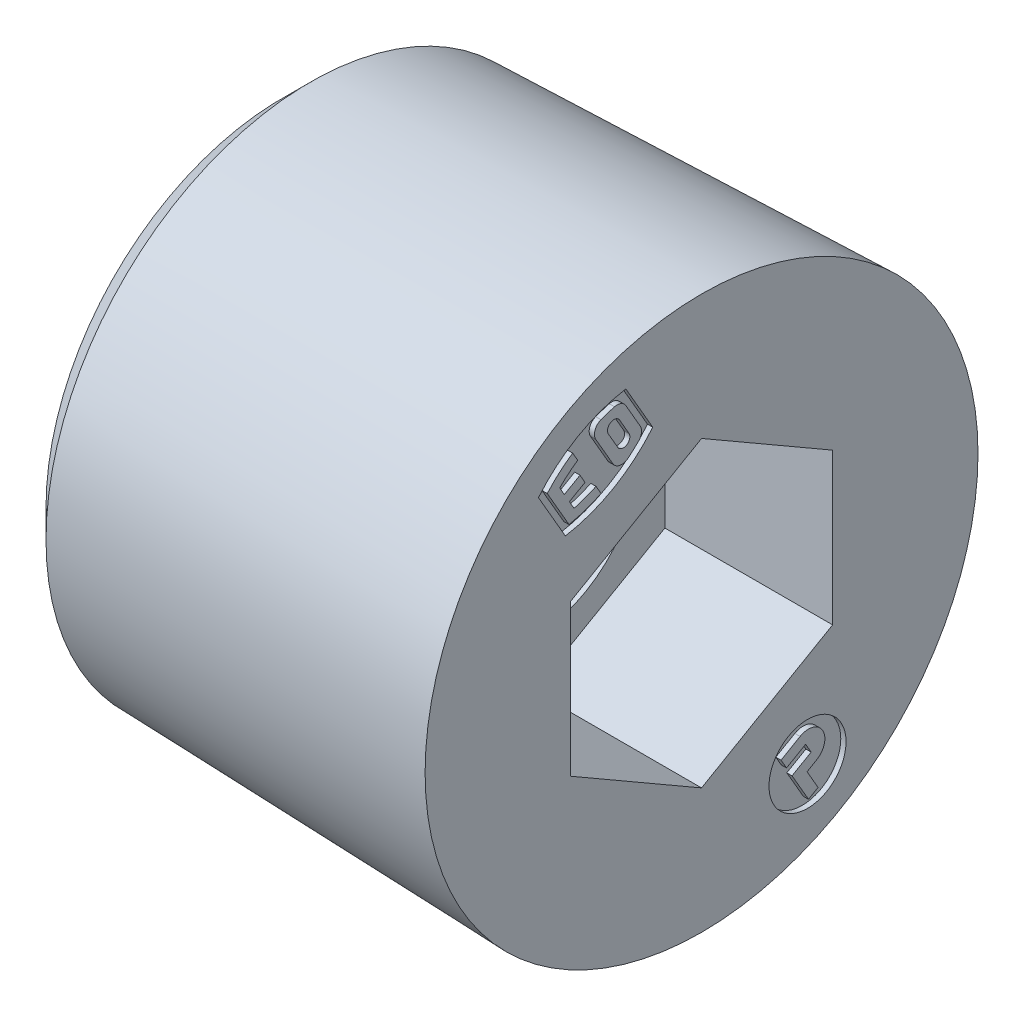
ISO-10303-21;
HEADER;
FILE_DESCRIPTION(('STEP AP214'),'2;1');
FILE_NAME('part.step','',(''),(''),'','','');
FILE_SCHEMA(('AUTOMOTIVE_DESIGN { 1 0 10303 214 1 1 1 1 }'));
ENDSEC;
DATA;
#1=APPLICATION_CONTEXT('core data for automotive mechanical design processes');
#2=APPLICATION_PROTOCOL_DEFINITION('international standard','automotive_design',2000,#1);
#3=PRODUCT_CONTEXT('',#1,'mechanical');
#4=PRODUCT('Part','Part','',(#3));
#5=PRODUCT_RELATED_PRODUCT_CATEGORY('part','',(#4));
#6=PRODUCT_DEFINITION_FORMATION('','',#4);
#7=PRODUCT_DEFINITION_CONTEXT('part definition',#1,'design');
#8=PRODUCT_DEFINITION('design','',#6,#7);
#9=PRODUCT_DEFINITION_SHAPE('','',#8);
#10=(LENGTH_UNIT() NAMED_UNIT(*) SI_UNIT(.MILLI.,.METRE.));
#11=(NAMED_UNIT(*) PLANE_ANGLE_UNIT() SI_UNIT($,.RADIAN.));
#12=(NAMED_UNIT(*) SI_UNIT($,.STERADIAN.) SOLID_ANGLE_UNIT());
#13=UNCERTAINTY_MEASURE_WITH_UNIT(LENGTH_MEASURE(1.E-05),#10,'distance_accuracy_value','');
#14=(GEOMETRIC_REPRESENTATION_CONTEXT(3) GLOBAL_UNCERTAINTY_ASSIGNED_CONTEXT((#13)) GLOBAL_UNIT_ASSIGNED_CONTEXT((#10,
#11,#12)) REPRESENTATION_CONTEXT('',''));
#15=CARTESIAN_POINT('',(0.,0.,0.));
#16=DIRECTION('',(0.,0.,1.));
#17=DIRECTION('',(1.,0.,0.));
#18=AXIS2_PLACEMENT_3D('',#15,#16,#17);
#19=CARTESIAN_POINT('',(0.,-6.49843992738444,-4.07519213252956));
#20=DIRECTION('',(1.,0.,0.));
#21=DIRECTION('',(0.,1.,0.));
#22=AXIS2_PLACEMENT_3D('',#19,#20,#21);
#23=PLANE('',#22);
#24=DIRECTION('',(0.,-0.5,0.866025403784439));
#25=VECTOR('',#24,1.);
#26=CARTESIAN_POINT('',(0.,-5.95284389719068,-3.76019217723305));
#27=LINE('',#26,#25);
#28=CARTESIAN_POINT('',(0.,-5.95284389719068,-3.76019217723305));
#29=VERTEX_POINT('',#28);
#30=CARTESIAN_POINT('',(0.,-6.37284389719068,-3.03273083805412));
#31=VERTEX_POINT('',#30);
#32=EDGE_CURVE('E779',#29,#31,#27,.T.);
#33=ORIENTED_EDGE('',*,*,#32,.T.);
#34=DIRECTION('',(0.,-0.866025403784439,-0.5));
#35=VECTOR('',#34,1.);
#36=CARTESIAN_POINT('',(0.,-6.37284389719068,-3.03273083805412));
#37=LINE('',#36,#35);
#38=CARTESIAN_POINT('',(0.,-6.73657456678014,-3.24273083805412));
#39=VERTEX_POINT('',#38);
#40=EDGE_CURVE('E566',#31,#39,#37,.T.);
#41=ORIENTED_EDGE('',*,*,#40,.T.);
#42=DIRECTION('',(0.,0.5,-0.866025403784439));
#43=VECTOR('',#42,1.);
#44=CARTESIAN_POINT('',(0.,-6.73657456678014,-3.24273083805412));
#45=LINE('',#44,#43);
#46=CARTESIAN_POINT('',(0.,-6.31657456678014,-3.97019217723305));
#47=VERTEX_POINT('',#46);
#48=EDGE_CURVE('E565',#39,#47,#45,.T.);
#49=ORIENTED_EDGE('',*,*,#48,.T.);
#50=DIRECTION('',(0.,-0.866025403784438,-0.5));
#51=VECTOR('',#50,1.);
#52=CARTESIAN_POINT('',(0.,-6.31657456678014,-3.97019217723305));
#53=LINE('',#52,#51);
#54=CARTESIAN_POINT('',(0.,-6.6803052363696,-4.18019217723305));
#55=VERTEX_POINT('',#54);
#56=EDGE_CURVE('E580',#47,#55,#53,.T.);
#57=ORIENTED_EDGE('',*,*,#56,.T.);
#58=DIRECTION('',(0.,-0.5,0.866025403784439));
#59=VECTOR('',#58,1.);
#60=CARTESIAN_POINT('',(0.,-6.6803052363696,-4.18019217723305));
#61=LINE('',#60,#59);
#62=CARTESIAN_POINT('',(0.,-7.1003052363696,-3.45273083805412));
#63=VERTEX_POINT('',#62);
#64=EDGE_CURVE('E579',#55,#63,#61,.T.);
#65=ORIENTED_EDGE('',*,*,#64,.T.);
#66=DIRECTION('',(0.,-0.866025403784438,-0.5));
#67=VECTOR('',#66,1.);
#68=CARTESIAN_POINT('',(0.,-7.1003052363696,-3.45273083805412));
#69=LINE('',#68,#67);
#70=CARTESIAN_POINT('',(0.,-8.191497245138,-4.08273083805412));
#71=VERTEX_POINT('',#70);
#72=EDGE_CURVE('E615',#63,#71,#69,.T.);
#73=ORIENTED_EDGE('',*,*,#72,.T.);
#74=DIRECTION('',(0.,0.5,-0.86602540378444));
#75=VECTOR('',#74,1.);
#76=CARTESIAN_POINT('',(0.,-8.191497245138,-4.08273083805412));
#77=LINE('',#76,#75);
#78=CARTESIAN_POINT('',(0.,-7.981497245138,-4.44646150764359));
#79=VERTEX_POINT('',#78);
#80=EDGE_CURVE('E464',#71,#79,#77,.T.);
#81=ORIENTED_EDGE('',*,*,#80,.T.);
#82=DIRECTION('',(0.,0.866025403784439,0.5));
#83=VECTOR('',#82,1.);
#84=CARTESIAN_POINT('',(0.,-7.981497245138,-4.44646150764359));
#85=LINE('',#84,#83);
#86=CARTESIAN_POINT('',(0.,-7.25403590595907,-4.02646150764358));
#87=VERTEX_POINT('',#86);
#88=EDGE_CURVE('E463',#79,#87,#85,.T.);
#89=ORIENTED_EDGE('',*,*,#88,.T.);
#90=DIRECTION('',(0.,0.5,-0.866025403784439));
#91=VECTOR('',#90,1.);
#92=CARTESIAN_POINT('',(0.,-7.25403590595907,-4.02646150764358));
#93=LINE('',#92,#91);
#94=CARTESIAN_POINT('',(0.,-7.04403590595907,-4.39019217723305));
#95=VERTEX_POINT('',#94);
#96=EDGE_CURVE('E606',#87,#95,#93,.T.);
#97=ORIENTED_EDGE('',*,*,#96,.T.);
#98=CARTESIAN_POINT('',(0.,-6.49843992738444,-4.07519213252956));
#99=DIRECTION('',(1.,0.,0.));
#100=DIRECTION('',(0.,0.,-1.));
#101=AXIS2_PLACEMENT_3D('',#98,#99,#100);
#102=CIRCLE('',#101,0.63);
#103=EDGE_CURVE('E11',#95,#29,#102,.T.);
#104=ORIENTED_EDGE('',*,*,#103,.T.);
#105=EDGE_LOOP('',(#33,#41,#49,#57,#65,#73,#81,#89,#97,#104));
#106=FACE_BOUND('',#105,.T.);
#107=ADVANCED_FACE('F16',(#106),#23,.T.);
#108=CARTESIAN_POINT('',(-0.2,-6.49843992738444,-4.07519213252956));
#109=DIRECTION('',(-1.,0.,0.));
#110=DIRECTION('',(0.,0.,-1.));
#111=AXIS2_PLACEMENT_3D('',#108,#109,#110);
#112=CYLINDRICAL_SURFACE('',#111,0.63);
#113=ORIENTED_EDGE('',*,*,#103,.F.);
#114=DIRECTION('',(1.,0.,0.));
#115=VECTOR('',#114,1.);
#116=CARTESIAN_POINT('',(-0.2,-7.04403590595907,-4.39019217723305));
#117=LINE('',#116,#115);
#118=CARTESIAN_POINT('',(-0.2,-7.04403590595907,-4.39019217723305));
#119=VERTEX_POINT('',#118);
#120=EDGE_CURVE('E27',#119,#95,#117,.T.);
#121=ORIENTED_EDGE('',*,*,#120,.F.);
#122=CARTESIAN_POINT('',(-0.2,-6.49843992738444,-4.07519213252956));
#123=DIRECTION('',(1.,0.,0.));
#124=DIRECTION('',(0.,0.,-1.));
#125=AXIS2_PLACEMENT_3D('',#122,#123,#124);
#126=CIRCLE('',#125,0.63);
#127=CARTESIAN_POINT('',(-0.2,-5.95284389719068,-3.76019217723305));
#128=VERTEX_POINT('',#127);
#129=EDGE_CURVE('E802',#119,#128,#126,.T.);
#130=ORIENTED_EDGE('',*,*,#129,.T.);
#131=DIRECTION('',(1.,0.,0.));
#132=VECTOR('',#131,1.);
#133=CARTESIAN_POINT('',(-0.2,-5.95284389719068,-3.76019217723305));
#134=LINE('',#133,#132);
#135=EDGE_CURVE('E658',#128,#29,#134,.T.);
#136=ORIENTED_EDGE('',*,*,#135,.T.);
#137=EDGE_LOOP('',(#113,#121,#130,#136));
#138=FACE_BOUND('',#137,.T.);
#139=ADVANCED_FACE('F960',(#138),#112,.T.);
#140=CARTESIAN_POINT('',(-0.2,-7.25403590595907,-4.02646150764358));
#141=DIRECTION('',(0.,-0.866025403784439,-0.5));
#142=DIRECTION('',(0.,0.5,-0.866025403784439));
#143=AXIS2_PLACEMENT_3D('',#140,#141,#142);
#144=PLANE('',#143);
#145=ORIENTED_EDGE('',*,*,#96,.F.);
#146=DIRECTION('',(1.,0.,0.));
#147=VECTOR('',#146,1.);
#148=CARTESIAN_POINT('',(-0.2,-7.25403590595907,-4.02646150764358));
#149=LINE('',#148,#147);
#150=CARTESIAN_POINT('',(-0.2,-7.25403590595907,-4.02646150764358));
#151=VERTEX_POINT('',#150);
#152=EDGE_CURVE('E556',#151,#87,#149,.T.);
#153=ORIENTED_EDGE('',*,*,#152,.F.);
#154=DIRECTION('',(0.,0.5,-0.866025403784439));
#155=VECTOR('',#154,1.);
#156=CARTESIAN_POINT('',(-0.2,-7.25403590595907,-4.02646150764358));
#157=LINE('',#156,#155);
#158=EDGE_CURVE('E546',#151,#119,#157,.T.);
#159=ORIENTED_EDGE('',*,*,#158,.T.);
#160=ORIENTED_EDGE('',*,*,#120,.T.);
#161=EDGE_LOOP('',(#145,#153,#159,#160));
#162=FACE_BOUND('',#161,.T.);
#163=ADVANCED_FACE('F966',(#162),#144,.T.);
#164=CARTESIAN_POINT('',(-0.2,-7.981497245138,-4.44646150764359));
#165=DIRECTION('',(0.,0.5,-0.866025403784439));
#166=DIRECTION('',(-1.,0.,0.));
#167=AXIS2_PLACEMENT_3D('',#164,#165,#166);
#168=PLANE('',#167);
#169=ORIENTED_EDGE('',*,*,#88,.F.);
#170=DIRECTION('',(1.,0.,0.));
#171=VECTOR('',#170,1.);
#172=CARTESIAN_POINT('',(-0.2,-7.981497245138,-4.44646150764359));
#173=LINE('',#172,#171);
#174=CARTESIAN_POINT('',(-0.2,-7.981497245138,-4.44646150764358));
#175=VERTEX_POINT('',#174);
#176=EDGE_CURVE('E459',#175,#79,#173,.T.);
#177=ORIENTED_EDGE('',*,*,#176,.F.);
#178=DIRECTION('',(0.,0.866025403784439,0.5));
#179=VECTOR('',#178,1.);
#180=CARTESIAN_POINT('',(-0.2,-7.981497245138,-4.44646150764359));
#181=LINE('',#180,#179);
#182=EDGE_CURVE('E533',#175,#151,#181,.T.);
#183=ORIENTED_EDGE('',*,*,#182,.T.);
#184=ORIENTED_EDGE('',*,*,#152,.T.);
#185=EDGE_LOOP('',(#169,#177,#183,#184));
#186=FACE_BOUND('',#185,.T.);
#187=ADVANCED_FACE('F1041',(#186),#168,.T.);
#188=CARTESIAN_POINT('',(-0.2,-8.191497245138,-4.08273083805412));
#189=DIRECTION('',(0.,-0.86602540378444,-0.5));
#190=DIRECTION('',(0.,0.5,-0.86602540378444));
#191=AXIS2_PLACEMENT_3D('',#188,#189,#190);
#192=PLANE('',#191);
#193=ORIENTED_EDGE('',*,*,#80,.F.);
#194=DIRECTION('',(1.,0.,0.));
#195=VECTOR('',#194,1.);
#196=CARTESIAN_POINT('',(-0.2,-8.191497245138,-4.08273083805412));
#197=LINE('',#196,#195);
#198=CARTESIAN_POINT('',(-0.2,-8.191497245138,-4.08273083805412));
#199=VERTEX_POINT('',#198);
#200=EDGE_CURVE('E618',#199,#71,#197,.T.);
#201=ORIENTED_EDGE('',*,*,#200,.F.);
#202=DIRECTION('',(0.,0.5,-0.86602540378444));
#203=VECTOR('',#202,1.);
#204=CARTESIAN_POINT('',(-0.2,-8.191497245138,-4.08273083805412));
#205=LINE('',#204,#203);
#206=EDGE_CURVE('E528',#199,#175,#205,.T.);
#207=ORIENTED_EDGE('',*,*,#206,.T.);
#208=ORIENTED_EDGE('',*,*,#176,.T.);
#209=EDGE_LOOP('',(#193,#201,#207,#208));
#210=FACE_BOUND('',#209,.T.);
#211=ADVANCED_FACE('F1044',(#210),#192,.T.);
#212=CARTESIAN_POINT('',(-0.2,-7.1003052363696,-3.45273083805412));
#213=DIRECTION('',(0.,-0.5,0.866025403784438));
#214=DIRECTION('',(-1.,0.,0.));
#215=AXIS2_PLACEMENT_3D('',#212,#213,#214);
#216=PLANE('',#215);
#217=ORIENTED_EDGE('',*,*,#72,.F.);
#218=DIRECTION('',(1.,0.,0.));
#219=VECTOR('',#218,1.);
#220=CARTESIAN_POINT('',(-0.2,-7.1003052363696,-3.45273083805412));
#221=LINE('',#220,#219);
#222=CARTESIAN_POINT('',(-0.2,-7.1003052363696,-3.45273083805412));
#223=VERTEX_POINT('',#222);
#224=EDGE_CURVE('E619',#223,#63,#221,.T.);
#225=ORIENTED_EDGE('',*,*,#224,.F.);
#226=DIRECTION('',(0.,-0.866025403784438,-0.5));
#227=VECTOR('',#226,1.);
#228=CARTESIAN_POINT('',(-0.2,-7.1003052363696,-3.45273083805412));
#229=LINE('',#228,#227);
#230=EDGE_CURVE('E532',#223,#199,#229,.T.);
#231=ORIENTED_EDGE('',*,*,#230,.T.);
#232=ORIENTED_EDGE('',*,*,#200,.T.);
#233=EDGE_LOOP('',(#217,#225,#231,#232));
#234=FACE_BOUND('',#233,.T.);
#235=ADVANCED_FACE('F1076',(#234),#216,.T.);
#236=CARTESIAN_POINT('',(-0.2,-6.6803052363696,-4.18019217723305));
#237=DIRECTION('',(0.,0.866025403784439,0.5));
#238=DIRECTION('',(1.,0.,0.));
#239=AXIS2_PLACEMENT_3D('',#236,#237,#238);
#240=PLANE('',#239);
#241=ORIENTED_EDGE('',*,*,#64,.F.);
#242=DIRECTION('',(1.,0.,0.));
#243=VECTOR('',#242,1.);
#244=CARTESIAN_POINT('',(-0.2,-6.6803052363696,-4.18019217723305));
#245=LINE('',#244,#243);
#246=CARTESIAN_POINT('',(-0.2,-6.6803052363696,-4.18019217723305));
#247=VERTEX_POINT('',#246);
#248=EDGE_CURVE('E575',#247,#55,#245,.T.);
#249=ORIENTED_EDGE('',*,*,#248,.F.);
#250=DIRECTION('',(0.,-0.5,0.866025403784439));
#251=VECTOR('',#250,1.);
#252=CARTESIAN_POINT('',(-0.2,-6.6803052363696,-4.18019217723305));
#253=LINE('',#252,#251);
#254=EDGE_CURVE('E758',#247,#223,#253,.T.);
#255=ORIENTED_EDGE('',*,*,#254,.T.);
#256=ORIENTED_EDGE('',*,*,#224,.T.);
#257=EDGE_LOOP('',(#241,#249,#255,#256));
#258=FACE_BOUND('',#257,.T.);
#259=ADVANCED_FACE('F1321',(#258),#240,.T.);
#260=CARTESIAN_POINT('',(-0.2,-6.31657456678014,-3.97019217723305));
#261=DIRECTION('',(0.,-0.5,0.866025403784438));
#262=DIRECTION('',(-1.,0.,0.));
#263=AXIS2_PLACEMENT_3D('',#260,#261,#262);
#264=PLANE('',#263);
#265=ORIENTED_EDGE('',*,*,#56,.F.);
#266=DIRECTION('',(1.,0.,0.));
#267=VECTOR('',#266,1.);
#268=CARTESIAN_POINT('',(-0.2,-6.31657456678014,-3.97019217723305));
#269=LINE('',#268,#267);
#270=CARTESIAN_POINT('',(-0.2,-6.31657456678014,-3.97019217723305));
#271=VERTEX_POINT('',#270);
#272=EDGE_CURVE('E624',#271,#47,#269,.T.);
#273=ORIENTED_EDGE('',*,*,#272,.F.);
#274=DIRECTION('',(0.,-0.866025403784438,-0.5));
#275=VECTOR('',#274,1.);
#276=CARTESIAN_POINT('',(-0.2,-6.31657456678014,-3.97019217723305));
#277=LINE('',#276,#275);
#278=EDGE_CURVE('E486',#271,#247,#277,.T.);
#279=ORIENTED_EDGE('',*,*,#278,.T.);
#280=ORIENTED_EDGE('',*,*,#248,.T.);
#281=EDGE_LOOP('',(#265,#273,#279,#280));
#282=FACE_BOUND('',#281,.T.);
#283=ADVANCED_FACE('F1304',(#282),#264,.T.);
#284=CARTESIAN_POINT('',(-0.2,-6.73657456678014,-3.24273083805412));
#285=DIRECTION('',(0.,-0.866025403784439,-0.5));
#286=DIRECTION('',(0.,0.5,-0.866025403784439));
#287=AXIS2_PLACEMENT_3D('',#284,#285,#286);
#288=PLANE('',#287);
#289=ORIENTED_EDGE('',*,*,#48,.F.);
#290=DIRECTION('',(1.,0.,0.));
#291=VECTOR('',#290,1.);
#292=CARTESIAN_POINT('',(-0.2,-6.73657456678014,-3.24273083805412));
#293=LINE('',#292,#291);
#294=CARTESIAN_POINT('',(-0.2,-6.73657456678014,-3.24273083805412));
#295=VERTEX_POINT('',#294);
#296=EDGE_CURVE('E561',#295,#39,#293,.T.);
#297=ORIENTED_EDGE('',*,*,#296,.F.);
#298=DIRECTION('',(0.,0.5,-0.866025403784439));
#299=VECTOR('',#298,1.);
#300=CARTESIAN_POINT('',(-0.2,-6.73657456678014,-3.24273083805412));
#301=LINE('',#300,#299);
#302=EDGE_CURVE('E481',#295,#271,#301,.T.);
#303=ORIENTED_EDGE('',*,*,#302,.T.);
#304=ORIENTED_EDGE('',*,*,#272,.T.);
#305=EDGE_LOOP('',(#289,#297,#303,#304));
#306=FACE_BOUND('',#305,.T.);
#307=ADVANCED_FACE('F1243',(#306),#288,.T.);
#308=CARTESIAN_POINT('',(-0.2,-6.37284389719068,-3.03273083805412));
#309=DIRECTION('',(0.,-0.5,0.866025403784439));
#310=DIRECTION('',(-1.,0.,0.));
#311=AXIS2_PLACEMENT_3D('',#308,#309,#310);
#312=PLANE('',#311);
#313=ORIENTED_EDGE('',*,*,#40,.F.);
#314=DIRECTION('',(1.,0.,0.));
#315=VECTOR('',#314,1.);
#316=CARTESIAN_POINT('',(-0.2,-6.37284389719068,-3.03273083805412));
#317=LINE('',#316,#315);
#318=CARTESIAN_POINT('',(-0.2,-6.37284389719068,-3.03273083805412));
#319=VERTEX_POINT('',#318);
#320=EDGE_CURVE('E654',#319,#31,#317,.T.);
#321=ORIENTED_EDGE('',*,*,#320,.F.);
#322=DIRECTION('',(0.,-0.866025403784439,-0.5));
#323=VECTOR('',#322,1.);
#324=CARTESIAN_POINT('',(-0.2,-6.37284389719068,-3.03273083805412));
#325=LINE('',#324,#323);
#326=EDGE_CURVE('E485',#319,#295,#325,.T.);
#327=ORIENTED_EDGE('',*,*,#326,.T.);
#328=ORIENTED_EDGE('',*,*,#296,.T.);
#329=EDGE_LOOP('',(#313,#321,#327,#328));
#330=FACE_BOUND('',#329,.T.);
#331=ADVANCED_FACE('F1059',(#330),#312,.T.);
#332=CARTESIAN_POINT('',(-0.2,-5.95284389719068,-3.76019217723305));
#333=DIRECTION('',(0.,0.866025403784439,0.5));
#334=DIRECTION('',(1.,0.,0.));
#335=AXIS2_PLACEMENT_3D('',#332,#333,#334);
#336=PLANE('',#335);
#337=ORIENTED_EDGE('',*,*,#32,.F.);
#338=ORIENTED_EDGE('',*,*,#135,.F.);
#339=DIRECTION('',(0.,-0.5,0.866025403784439));
#340=VECTOR('',#339,1.);
#341=CARTESIAN_POINT('',(-0.2,-5.95284389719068,-3.76019217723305));
#342=LINE('',#341,#340);
#343=EDGE_CURVE('E667',#128,#319,#342,.T.);
#344=ORIENTED_EDGE('',*,*,#343,.T.);
#345=ORIENTED_EDGE('',*,*,#320,.T.);
#346=EDGE_LOOP('',(#337,#338,#344,#345));
#347=FACE_BOUND('',#346,.T.);
#348=ADVANCED_FACE('F1015',(#347),#336,.T.);
#349=CARTESIAN_POINT('',(-0.2,-7.00217057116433,-4.0427050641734));
#350=DIRECTION('',(1.,0.,0.));
#351=DIRECTION('',(0.,1.,0.));
#352=AXIS2_PLACEMENT_3D('',#349,#350,#351);
#353=PLANE('',#352);
#354=ORIENTED_EDGE('',*,*,#343,.F.);
#355=ORIENTED_EDGE('',*,*,#129,.F.);
#356=ORIENTED_EDGE('',*,*,#158,.F.);
#357=ORIENTED_EDGE('',*,*,#182,.F.);
#358=ORIENTED_EDGE('',*,*,#206,.F.);
#359=ORIENTED_EDGE('',*,*,#230,.F.);
#360=ORIENTED_EDGE('',*,*,#254,.F.);
#361=ORIENTED_EDGE('',*,*,#278,.F.);
#362=ORIENTED_EDGE('',*,*,#302,.F.);
#363=ORIENTED_EDGE('',*,*,#326,.F.);
#364=EDGE_LOOP('',(#354,#355,#356,#357,#358,#359,#360,#361,#362,#363));
#365=FACE_BOUND('',#364,.T.);
#366=CARTESIAN_POINT('',(-0.2,-7.00217057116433,-4.0427050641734));
#367=DIRECTION('',(1.,0.,0.));
#368=DIRECTION('',(0.,0.,-1.));
#369=AXIS2_PLACEMENT_3D('',#366,#367,#368);
#370=CIRCLE('',#369,1.47);
#371=CARTESIAN_POINT('',(-0.2,-7.00217057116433,-5.5127050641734));
#372=VERTEX_POINT('',#371);
#373=EDGE_CURVE('E664',#372,#372,#370,.T.);
#374=ORIENTED_EDGE('',*,*,#373,.T.);
#375=EDGE_LOOP('',(#374));
#376=FACE_BOUND('',#375,.T.);
#377=ADVANCED_FACE('F1011',(#365,#376),#353,.T.);
#378=CARTESIAN_POINT('',(-0.2,-7.00217057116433,-4.0427050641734));
#379=DIRECTION('',(-1.,0.,0.));
#380=DIRECTION('',(0.,0.,-1.));
#381=AXIS2_PLACEMENT_3D('',#378,#379,#380);
#382=CYLINDRICAL_SURFACE('',#381,1.47);
#383=ORIENTED_EDGE('',*,*,#373,.F.);
#384=EDGE_LOOP('',(#383));
#385=FACE_BOUND('',#384,.T.);
#386=CARTESIAN_POINT('',(0.,-7.00217057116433,-4.0427050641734));
#387=DIRECTION('',(1.,0.,0.));
#388=DIRECTION('',(0.,0.,-1.));
#389=AXIS2_PLACEMENT_3D('',#386,#387,#388);
#390=CIRCLE('',#389,1.47);
#391=CARTESIAN_POINT('',(0.,-7.00217057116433,-5.5127050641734));
#392=VERTEX_POINT('',#391);
#393=EDGE_CURVE('E571',#392,#392,#390,.T.);
#394=ORIENTED_EDGE('',*,*,#393,.T.);
#395=EDGE_LOOP('',(#394));
#396=FACE_BOUND('',#395,.T.);
#397=ADVANCED_FACE('F1014',(#385,#396),#382,.F.);
#398=CARTESIAN_POINT('',(-0.2,3.42981578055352,1.98020506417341));
#399=DIRECTION('',(1.,0.,0.));
#400=DIRECTION('',(0.,1.,0.));
#401=AXIS2_PLACEMENT_3D('',#398,#399,#400);
#402=PLANE('',#401);
#403=CARTESIAN_POINT('',(-0.2,7.2013164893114,2.98277421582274));
#404=DIRECTION('',(1.,0.,0.));
#405=DIRECTION('',(0.,0.,-1.));
#406=AXIS2_PLACEMENT_3D('',#403,#404,#405);
#407=CIRCLE('',#406,0.2475);
#408=CARTESIAN_POINT('',(-0.2,7.0775664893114,3.19711550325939));
#409=VERTEX_POINT('',#408);
#410=CARTESIAN_POINT('',(-0.2,7.3250664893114,2.76843292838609));
#411=VERTEX_POINT('',#410);
#412=EDGE_CURVE('E768',#409,#411,#407,.T.);
#413=ORIENTED_EDGE('',*,*,#412,.T.);
#414=DIRECTION('',(0.,0.866025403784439,0.5));
#415=VECTOR('',#414,1.);
#416=CARTESIAN_POINT('',(-0.2,7.3250664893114,2.76843292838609));
#417=LINE('',#416,#415);
#418=CARTESIAN_POINT('',(-0.2,7.94427465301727,3.12593292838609));
#419=VERTEX_POINT('',#418);
#420=EDGE_CURVE('E745',#411,#419,#417,.T.);
#421=ORIENTED_EDGE('',*,*,#420,.T.);
#422=CARTESIAN_POINT('',(-0.2,7.82052465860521,3.34027421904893));
#423=DIRECTION('',(1.,0.,0.));
#424=DIRECTION('',(0.,0.,-1.));
#425=AXIS2_PLACEMENT_3D('',#422,#423,#424);
#426=CIRCLE('',#425,0.2475);
#427=CARTESIAN_POINT('',(-0.2,7.69677465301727,3.55461550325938));
#428=VERTEX_POINT('',#427);
#429=EDGE_CURVE('E20',#419,#428,#426,.T.);
#430=ORIENTED_EDGE('',*,*,#429,.T.);
#431=DIRECTION('',(0.,-0.866025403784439,-0.5));
#432=VECTOR('',#431,1.);
#433=CARTESIAN_POINT('',(-0.2,7.69677465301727,3.55461550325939));
#434=LINE('',#433,#432);
#435=EDGE_CURVE('E496',#428,#409,#434,.T.);
#436=ORIENTED_EDGE('',*,*,#435,.T.);
#437=EDGE_LOOP('',(#413,#421,#430,#436));
#438=FACE_BOUND('',#437,.T.);
#439=ADVANCED_FACE('F1039',(#438),#402,.T.);
#440=CARTESIAN_POINT('',(0.,3.42981578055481,1.98020506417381));
#441=DIRECTION('',(1.,0.,0.));
#442=DIRECTION('',(0.,1.,0.));
#443=AXIS2_PLACEMENT_3D('',#440,#441,#442);
#444=PLANE('',#443);
#445=DIRECTION('',(0.,0.866025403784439,0.5));
#446=VECTOR('',#445,1.);
#447=CARTESIAN_POINT('',(0.,7.3250664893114,2.76843292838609));
#448=LINE('',#447,#446);
#449=CARTESIAN_POINT('',(0.,7.3250664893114,2.76843292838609));
#450=VERTEX_POINT('',#449);
#451=CARTESIAN_POINT('',(0.,7.94427465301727,3.12593292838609));
#452=VERTEX_POINT('',#451);
#453=EDGE_CURVE('E609',#450,#452,#448,.T.);
#454=ORIENTED_EDGE('',*,*,#453,.F.);
#455=CARTESIAN_POINT('',(0.,7.2013164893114,2.98277421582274));
#456=DIRECTION('',(1.,0.,0.));
#457=DIRECTION('',(0.,0.,-1.));
#458=AXIS2_PLACEMENT_3D('',#455,#456,#457);
#459=CIRCLE('',#458,0.2475);
#460=CARTESIAN_POINT('',(0.,7.0775664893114,3.19711550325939));
#461=VERTEX_POINT('',#460);
#462=EDGE_CURVE('E771',#461,#450,#459,.T.);
#463=ORIENTED_EDGE('',*,*,#462,.F.);
#464=DIRECTION('',(0.,-0.866025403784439,-0.5));
#465=VECTOR('',#464,1.);
#466=CARTESIAN_POINT('',(0.,7.69677465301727,3.55461550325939));
#467=LINE('',#466,#465);
#468=CARTESIAN_POINT('',(0.,7.69677465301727,3.55461550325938));
#469=VERTEX_POINT('',#468);
#470=EDGE_CURVE('E493',#469,#461,#467,.T.);
#471=ORIENTED_EDGE('',*,*,#470,.F.);
#472=CARTESIAN_POINT('',(0.,7.82052465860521,3.34027421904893));
#473=DIRECTION('',(1.,0.,0.));
#474=DIRECTION('',(0.,0.,-1.));
#475=AXIS2_PLACEMENT_3D('',#472,#473,#474);
#476=CIRCLE('',#475,0.2475);
#477=EDGE_CURVE('E801',#452,#469,#476,.T.);
#478=ORIENTED_EDGE('',*,*,#477,.F.);
#479=EDGE_LOOP('',(#454,#463,#471,#478));
#480=FACE_BOUND('',#479,.T.);
#481=CARTESIAN_POINT('',(0.,3.42981578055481,1.98020506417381));
#482=DIRECTION('',(1.,0.,0.));
#483=DIRECTION('',(0.,0.,-1.));
#484=AXIS2_PLACEMENT_3D('',#481,#482,#483);
#485=CIRCLE('',#484,5.225);
#486=CARTESIAN_POINT('',(0.,8.48032447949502,3.31922966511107));
#487=VERTEX_POINT('',#486);
#488=CARTESIAN_POINT('',(0.,8.31279305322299,3.83954848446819));
#489=VERTEX_POINT('',#488);
#490=EDGE_CURVE('E475',#487,#489,#485,.T.);
#491=ORIENTED_EDGE('',*,*,#490,.T.);
#492=CARTESIAN_POINT('',(0.,7.9529947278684,3.70254423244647));
#493=DIRECTION('',(1.,0.,0.));
#494=DIRECTION('',(0.,0.,-1.));
#495=AXIS2_PLACEMENT_3D('',#492,#493,#494);
#496=CIRCLE('',#495,0.385);
#497=CARTESIAN_POINT('',(0.,7.7604947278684,4.03596401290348));
#498=VERTEX_POINT('',#497);
#499=EDGE_CURVE('E592',#489,#498,#496,.T.);
#500=ORIENTED_EDGE('',*,*,#499,.T.);
#501=DIRECTION('',(0.,-0.866025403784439,-0.5));
#502=VECTOR('',#501,1.);
#503=CARTESIAN_POINT('',(0.,7.7604947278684,4.03596401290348));
#504=LINE('',#503,#502);
#505=CARTESIAN_POINT('',(0.,6.62884641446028,3.38260655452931));
#506=VERTEX_POINT('',#505);
#507=EDGE_CURVE('E458',#498,#506,#504,.T.);
#508=ORIENTED_EDGE('',*,*,#507,.T.);
#509=CARTESIAN_POINT('',(0.,6.82134641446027,3.0491867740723));
#510=DIRECTION('',(1.,0.,0.));
#511=DIRECTION('',(0.,0.,-1.));
#512=AXIS2_PLACEMENT_3D('',#509,#510,#511);
#513=CIRCLE('',#512,0.385);
#514=CARTESIAN_POINT('',(0.,6.52279808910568,2.80609441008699));
#515=VERTEX_POINT('',#514);
#516=EDGE_CURVE('E408',#506,#515,#513,.T.);
#517=ORIENTED_EDGE('',*,*,#516,.T.);
#518=CARTESIAN_POINT('',(0.,10.574525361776,6.10520506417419));
#519=DIRECTION('',(1.,0.,0.));
#520=DIRECTION('',(0.,0.,-1.));
#521=AXIS2_PLACEMENT_3D('',#518,#519,#520);
#522=CIRCLE('',#521,5.225);
#523=CARTESIAN_POINT('',(0.,6.88964167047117,2.40084855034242));
#524=VERTEX_POINT('',#523);
#525=EDGE_CURVE('E404',#515,#524,#522,.T.);
#526=ORIENTED_EDGE('',*,*,#525,.T.);
#527=CARTESIAN_POINT('',(0.,7.1611594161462,2.67380113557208));
#528=DIRECTION('',(1.,0.,0.));
#529=DIRECTION('',(0.,0.,-1.));
#530=AXIS2_PLACEMENT_3D('',#527,#528,#529);
#531=CIRCLE('',#530,0.385);
#532=CARTESIAN_POINT('',(0.,7.3536594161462,2.34038135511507));
#533=VERTEX_POINT('',#532);
#534=EDGE_CURVE('E598',#524,#533,#531,.T.);
#535=ORIENTED_EDGE('',*,*,#534,.T.);
#536=DIRECTION('',(0.,0.866025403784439,0.5));
#537=VECTOR('',#536,1.);
#538=CARTESIAN_POINT('',(0.,7.3536594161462,2.34038135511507));
#539=LINE('',#538,#537);
#540=CARTESIAN_POINT('',(0.,8.30068172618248,2.88714494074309));
#541=VERTEX_POINT('',#540);
#542=EDGE_CURVE('E610',#533,#541,#539,.T.);
#543=ORIENTED_EDGE('',*,*,#542,.T.);
#544=CARTESIAN_POINT('',(0.,8.10818172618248,3.2205647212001));
#545=DIRECTION('',(1.,0.,0.));
#546=DIRECTION('',(0.,0.,-1.));
#547=AXIS2_PLACEMENT_3D('',#544,#545,#546);
#548=CIRCLE('',#547,0.385);
#549=EDGE_CURVE('E668',#541,#487,#548,.T.);
#550=ORIENTED_EDGE('',*,*,#549,.T.);
#551=EDGE_LOOP('',(#491,#500,#508,#517,#526,#535,#543,#550));
#552=FACE_BOUND('',#551,.T.);
#553=ADVANCED_FACE('F975',(#480,#552),#444,.T.);
#554=CARTESIAN_POINT('',(-0.2,8.10818172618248,3.2205647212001));
#555=DIRECTION('',(-1.,0.,0.));
#556=DIRECTION('',(0.,0.,-1.));
#557=AXIS2_PLACEMENT_3D('',#554,#555,#556);
#558=CYLINDRICAL_SURFACE('',#557,0.385);
#559=ORIENTED_EDGE('',*,*,#549,.F.);
#560=DIRECTION('',(1.,0.,0.));
#561=VECTOR('',#560,1.);
#562=CARTESIAN_POINT('',(-0.2,8.30068172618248,2.88714494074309));
#563=LINE('',#562,#561);
#564=CARTESIAN_POINT('',(-0.2,8.30068172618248,2.88714494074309));
#565=VERTEX_POINT('',#564);
#566=EDGE_CURVE('E358',#565,#541,#563,.T.);
#567=ORIENTED_EDGE('',*,*,#566,.F.);
#568=CARTESIAN_POINT('',(-0.2,8.10818172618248,3.2205647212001));
#569=DIRECTION('',(1.,0.,0.));
#570=DIRECTION('',(0.,0.,-1.));
#571=AXIS2_PLACEMENT_3D('',#568,#569,#570);
#572=CIRCLE('',#571,0.385);
#573=CARTESIAN_POINT('',(-0.2,8.48032447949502,3.31922966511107));
#574=VERTEX_POINT('',#573);
#575=EDGE_CURVE('E574',#565,#574,#572,.T.);
#576=ORIENTED_EDGE('',*,*,#575,.T.);
#577=DIRECTION('',(1.,0.,0.));
#578=VECTOR('',#577,1.);
#579=CARTESIAN_POINT('',(-0.2,8.48032447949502,3.31922966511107));
#580=LINE('',#579,#578);
#581=EDGE_CURVE('E479',#574,#487,#580,.T.);
#582=ORIENTED_EDGE('',*,*,#581,.T.);
#583=EDGE_LOOP('',(#559,#567,#576,#582));
#584=FACE_BOUND('',#583,.T.);
#585=ADVANCED_FACE('F971',(#584),#558,.T.);
#586=CARTESIAN_POINT('',(-0.2,7.82052465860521,3.34027421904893));
#587=DIRECTION('',(-1.,0.,0.));
#588=DIRECTION('',(0.,0.,-1.));
#589=AXIS2_PLACEMENT_3D('',#586,#587,#588);
#590=CYLINDRICAL_SURFACE('',#589,0.2475);
#591=ORIENTED_EDGE('',*,*,#477,.T.);
#592=DIRECTION('',(1.,0.,0.));
#593=VECTOR('',#592,1.);
#594=CARTESIAN_POINT('',(-0.2,7.69677465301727,3.55461550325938));
#595=LINE('',#594,#593);
#596=EDGE_CURVE('E791',#428,#469,#595,.T.);
#597=ORIENTED_EDGE('',*,*,#596,.F.);
#598=ORIENTED_EDGE('',*,*,#429,.F.);
#599=DIRECTION('',(1.,0.,0.));
#600=VECTOR('',#599,1.);
#601=CARTESIAN_POINT('',(-0.2,7.94427465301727,3.12593292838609));
#602=LINE('',#601,#600);
#603=EDGE_CURVE('E653',#419,#452,#602,.T.);
#604=ORIENTED_EDGE('',*,*,#603,.T.);
#605=EDGE_LOOP('',(#591,#597,#598,#604));
#606=FACE_BOUND('',#605,.T.);
#607=ADVANCED_FACE('F974',(#606),#590,.F.);
#608=CARTESIAN_POINT('',(-0.2,7.69677465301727,3.55461550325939));
#609=DIRECTION('',(0.,-0.5,0.866025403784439));
#610=DIRECTION('',(-1.,0.,0.));
#611=AXIS2_PLACEMENT_3D('',#608,#609,#610);
#612=PLANE('',#611);
#613=ORIENTED_EDGE('',*,*,#470,.T.);
#614=DIRECTION('',(1.,0.,0.));
#615=VECTOR('',#614,1.);
#616=CARTESIAN_POINT('',(-0.2,7.0775664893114,3.19711550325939));
#617=LINE('',#616,#615);
#618=EDGE_CURVE('E497',#409,#461,#617,.T.);
#619=ORIENTED_EDGE('',*,*,#618,.F.);
#620=ORIENTED_EDGE('',*,*,#435,.F.);
#621=ORIENTED_EDGE('',*,*,#596,.T.);
#622=EDGE_LOOP('',(#613,#619,#620,#621));
#623=FACE_BOUND('',#622,.T.);
#624=ADVANCED_FACE('F1049',(#623),#612,.F.);
#625=CARTESIAN_POINT('',(-0.2,7.2013164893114,2.98277421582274));
#626=DIRECTION('',(-1.,0.,0.));
#627=DIRECTION('',(0.,0.,-1.));
#628=AXIS2_PLACEMENT_3D('',#625,#626,#627);
#629=CYLINDRICAL_SURFACE('',#628,0.2475);
#630=ORIENTED_EDGE('',*,*,#462,.T.);
#631=DIRECTION('',(1.,0.,0.));
#632=VECTOR('',#631,1.);
#633=CARTESIAN_POINT('',(-0.2,7.3250664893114,2.76843292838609));
#634=LINE('',#633,#632);
#635=EDGE_CURVE('E749',#411,#450,#634,.T.);
#636=ORIENTED_EDGE('',*,*,#635,.F.);
#637=ORIENTED_EDGE('',*,*,#412,.F.);
#638=ORIENTED_EDGE('',*,*,#618,.T.);
#639=EDGE_LOOP('',(#630,#636,#637,#638));
#640=FACE_BOUND('',#639,.T.);
#641=ADVANCED_FACE('F1046',(#640),#629,.F.);
#642=CARTESIAN_POINT('',(-0.2,7.3250664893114,2.76843292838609));
#643=DIRECTION('',(0.,0.5,-0.866025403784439));
#644=DIRECTION('',(-1.,0.,0.));
#645=AXIS2_PLACEMENT_3D('',#642,#643,#644);
#646=PLANE('',#645);
#647=ORIENTED_EDGE('',*,*,#453,.T.);
#648=ORIENTED_EDGE('',*,*,#603,.F.);
#649=ORIENTED_EDGE('',*,*,#420,.F.);
#650=ORIENTED_EDGE('',*,*,#635,.T.);
#651=EDGE_LOOP('',(#647,#648,#649,#650));
#652=FACE_BOUND('',#651,.T.);
#653=ADVANCED_FACE('F18',(#652),#646,.F.);
#654=CARTESIAN_POINT('',(-0.2,7.3536594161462,2.34038135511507));
#655=DIRECTION('',(0.,0.5,-0.866025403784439));
#656=DIRECTION('',(-1.,0.,0.));
#657=AXIS2_PLACEMENT_3D('',#654,#655,#656);
#658=PLANE('',#657);
#659=ORIENTED_EDGE('',*,*,#542,.F.);
#660=DIRECTION('',(1.,0.,0.));
#661=VECTOR('',#660,1.);
#662=CARTESIAN_POINT('',(-0.2,7.3536594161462,2.34038135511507));
#663=LINE('',#662,#661);
#664=CARTESIAN_POINT('',(-0.2,7.3536594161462,2.34038135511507));
#665=VERTEX_POINT('',#664);
#666=EDGE_CURVE('E602',#665,#533,#663,.T.);
#667=ORIENTED_EDGE('',*,*,#666,.F.);
#668=DIRECTION('',(0.,0.866025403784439,0.5));
#669=VECTOR('',#668,1.);
#670=CARTESIAN_POINT('',(-0.2,7.3536594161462,2.34038135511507));
#671=LINE('',#670,#669);
#672=EDGE_CURVE('E433',#665,#565,#671,.T.);
#673=ORIENTED_EDGE('',*,*,#672,.T.);
#674=ORIENTED_EDGE('',*,*,#566,.T.);
#675=EDGE_LOOP('',(#659,#667,#673,#674));
#676=FACE_BOUND('',#675,.T.);
#677=ADVANCED_FACE('F1073',(#676),#658,.T.);
#678=CARTESIAN_POINT('',(-0.2,7.1611594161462,2.67380113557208));
#679=DIRECTION('',(-1.,0.,0.));
#680=DIRECTION('',(0.,0.,-1.));
#681=AXIS2_PLACEMENT_3D('',#678,#679,#680);
#682=CYLINDRICAL_SURFACE('',#681,0.385);
#683=ORIENTED_EDGE('',*,*,#534,.F.);
#684=DIRECTION('',(1.,0.,0.));
#685=VECTOR('',#684,1.);
#686=CARTESIAN_POINT('',(-0.2,6.88964167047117,2.40084855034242));
#687=LINE('',#686,#685);
#688=CARTESIAN_POINT('',(-0.2,6.88964167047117,2.40084855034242));
#689=VERTEX_POINT('',#688);
#690=EDGE_CURVE('E583',#689,#524,#687,.T.);
#691=ORIENTED_EDGE('',*,*,#690,.F.);
#692=CARTESIAN_POINT('',(-0.2,7.1611594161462,2.67380113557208));
#693=DIRECTION('',(1.,0.,0.));
#694=DIRECTION('',(0.,0.,-1.));
#695=AXIS2_PLACEMENT_3D('',#692,#693,#694);
#696=CIRCLE('',#695,0.385);
#697=EDGE_CURVE('E426',#689,#665,#696,.T.);
#698=ORIENTED_EDGE('',*,*,#697,.T.);
#699=ORIENTED_EDGE('',*,*,#666,.T.);
#700=EDGE_LOOP('',(#683,#691,#698,#699));
#701=FACE_BOUND('',#700,.T.);
#702=ADVANCED_FACE('F993',(#701),#682,.T.);
#703=CARTESIAN_POINT('',(-0.2,10.574525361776,6.10520506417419));
#704=DIRECTION('',(-1.,0.,0.));
#705=DIRECTION('',(0.,0.,-1.));
#706=AXIS2_PLACEMENT_3D('',#703,#704,#705);
#707=CYLINDRICAL_SURFACE('',#706,5.225);
#708=ORIENTED_EDGE('',*,*,#525,.F.);
#709=DIRECTION('',(1.,0.,0.));
#710=VECTOR('',#709,1.);
#711=CARTESIAN_POINT('',(-0.2,6.52279808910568,2.80609441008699));
#712=LINE('',#711,#710);
#713=CARTESIAN_POINT('',(-0.2,6.52279808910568,2.80609441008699));
#714=VERTEX_POINT('',#713);
#715=EDGE_CURVE('E396',#714,#515,#712,.T.);
#716=ORIENTED_EDGE('',*,*,#715,.F.);
#717=CARTESIAN_POINT('',(-0.2,10.574525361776,6.10520506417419));
#718=DIRECTION('',(1.,0.,0.));
#719=DIRECTION('',(0.,0.,-1.));
#720=AXIS2_PLACEMENT_3D('',#717,#718,#719);
#721=CIRCLE('',#720,5.225);
#722=EDGE_CURVE('E401',#714,#689,#721,.T.);
#723=ORIENTED_EDGE('',*,*,#722,.T.);
#724=ORIENTED_EDGE('',*,*,#690,.T.);
#725=EDGE_LOOP('',(#708,#716,#723,#724));
#726=FACE_BOUND('',#725,.T.);
#727=ADVANCED_FACE('F398',(#726),#707,.T.);
#728=CARTESIAN_POINT('',(-0.2,6.82134641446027,3.0491867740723));
#729=DIRECTION('',(-1.,0.,0.));
#730=DIRECTION('',(0.,0.,-1.));
#731=AXIS2_PLACEMENT_3D('',#728,#729,#730);
#732=CYLINDRICAL_SURFACE('',#731,0.385);
#733=ORIENTED_EDGE('',*,*,#516,.F.);
#734=DIRECTION('',(1.,0.,0.));
#735=VECTOR('',#734,1.);
#736=CARTESIAN_POINT('',(-0.2,6.62884641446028,3.38260655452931));
#737=LINE('',#736,#735);
#738=CARTESIAN_POINT('',(-0.2,6.62884641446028,3.38260655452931));
#739=VERTEX_POINT('',#738);
#740=EDGE_CURVE('E414',#739,#506,#737,.T.);
#741=ORIENTED_EDGE('',*,*,#740,.F.);
#742=CARTESIAN_POINT('',(-0.2,6.82134641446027,3.0491867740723));
#743=DIRECTION('',(1.,0.,0.));
#744=DIRECTION('',(0.,0.,-1.));
#745=AXIS2_PLACEMENT_3D('',#742,#743,#744);
#746=CIRCLE('',#745,0.385);
#747=EDGE_CURVE('E411',#739,#714,#746,.T.);
#748=ORIENTED_EDGE('',*,*,#747,.T.);
#749=ORIENTED_EDGE('',*,*,#715,.T.);
#750=EDGE_LOOP('',(#733,#741,#748,#749));
#751=FACE_BOUND('',#750,.T.);
#752=ADVANCED_FACE('F412',(#751),#732,.T.);
#753=CARTESIAN_POINT('',(-0.2,7.7604947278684,4.03596401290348));
#754=DIRECTION('',(0.,-0.5,0.866025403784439));
#755=DIRECTION('',(-1.,0.,0.));
#756=AXIS2_PLACEMENT_3D('',#753,#754,#755);
#757=PLANE('',#756);
#758=ORIENTED_EDGE('',*,*,#507,.F.);
#759=DIRECTION('',(1.,0.,0.));
#760=VECTOR('',#759,1.);
#761=CARTESIAN_POINT('',(-0.2,7.7604947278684,4.03596401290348));
#762=LINE('',#761,#760);
#763=CARTESIAN_POINT('',(-0.2,7.7604947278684,4.03596401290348));
#764=VERTEX_POINT('',#763);
#765=EDGE_CURVE('E588',#764,#498,#762,.T.);
#766=ORIENTED_EDGE('',*,*,#765,.F.);
#767=DIRECTION('',(0.,-0.866025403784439,-0.5));
#768=VECTOR('',#767,1.);
#769=CARTESIAN_POINT('',(-0.2,7.7604947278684,4.03596401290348));
#770=LINE('',#769,#768);
#771=EDGE_CURVE('E419',#764,#739,#770,.T.);
#772=ORIENTED_EDGE('',*,*,#771,.T.);
#773=ORIENTED_EDGE('',*,*,#740,.T.);
#774=EDGE_LOOP('',(#758,#766,#772,#773));
#775=FACE_BOUND('',#774,.T.);
#776=ADVANCED_FACE('F994',(#775),#757,.T.);
#777=CARTESIAN_POINT('',(-0.2,7.9529947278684,3.70254423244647));
#778=DIRECTION('',(-1.,0.,0.));
#779=DIRECTION('',(0.,0.,-1.));
#780=AXIS2_PLACEMENT_3D('',#777,#778,#779);
#781=CYLINDRICAL_SURFACE('',#780,0.385);
#782=ORIENTED_EDGE('',*,*,#499,.F.);
#783=DIRECTION('',(1.,0.,0.));
#784=VECTOR('',#783,1.);
#785=CARTESIAN_POINT('',(-0.2,8.31279305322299,3.83954848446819));
#786=LINE('',#785,#784);
#787=CARTESIAN_POINT('',(-0.2,8.31279305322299,3.83954848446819));
#788=VERTEX_POINT('',#787);
#789=EDGE_CURVE('E347',#788,#489,#786,.T.);
#790=ORIENTED_EDGE('',*,*,#789,.F.);
#791=CARTESIAN_POINT('',(-0.2,7.9529947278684,3.70254423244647));
#792=DIRECTION('',(1.,0.,0.));
#793=DIRECTION('',(0.,0.,-1.));
#794=AXIS2_PLACEMENT_3D('',#791,#792,#793);
#795=CIRCLE('',#794,0.385);
#796=EDGE_CURVE('E635',#788,#764,#795,.T.);
#797=ORIENTED_EDGE('',*,*,#796,.T.);
#798=ORIENTED_EDGE('',*,*,#765,.T.);
#799=EDGE_LOOP('',(#782,#790,#797,#798));
#800=FACE_BOUND('',#799,.T.);
#801=ADVANCED_FACE('F997',(#800),#781,.T.);
#802=CARTESIAN_POINT('',(-0.2,3.42981578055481,1.98020506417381));
#803=DIRECTION('',(-1.,0.,0.));
#804=DIRECTION('',(0.,0.,-1.));
#805=AXIS2_PLACEMENT_3D('',#802,#803,#804);
#806=CYLINDRICAL_SURFACE('',#805,5.225);
#807=ORIENTED_EDGE('',*,*,#490,.F.);
#808=ORIENTED_EDGE('',*,*,#581,.F.);
#809=CARTESIAN_POINT('',(-0.2,3.42981578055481,1.98020506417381));
#810=DIRECTION('',(1.,0.,0.));
#811=DIRECTION('',(0.,0.,-1.));
#812=AXIS2_PLACEMENT_3D('',#809,#810,#811);
#813=CIRCLE('',#812,5.225);
#814=EDGE_CURVE('E596',#574,#788,#813,.T.);
#815=ORIENTED_EDGE('',*,*,#814,.T.);
#816=ORIENTED_EDGE('',*,*,#789,.T.);
#817=EDGE_LOOP('',(#807,#808,#815,#816));
#818=FACE_BOUND('',#817,.T.);
#819=ADVANCED_FACE('F1032',(#818),#806,.T.);
#820=CARTESIAN_POINT('',(0.,3.42981578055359,1.98020506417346));
#821=DIRECTION('',(1.,0.,0.));
#822=DIRECTION('',(0.,1.,0.));
#823=AXIS2_PLACEMENT_3D('',#820,#821,#822);
#824=PLANE('',#823);
#825=CARTESIAN_POINT('',(0.,3.42981578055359,1.98020506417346));
#826=DIRECTION('',(1.,0.,0.));
#827=DIRECTION('',(0.,0.,-1.));
#828=AXIS2_PLACEMENT_3D('',#825,#826,#827);
#829=CIRCLE('',#828,5.225);
#830=CARTESIAN_POINT('',(0.,7.74999790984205,4.91902308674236));
#831=VERTEX_POINT('',#830);
#832=CARTESIAN_POINT('',(0.,6.89825190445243,5.88796348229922));
#833=VERTEX_POINT('',#832);
#834=EDGE_CURVE('E669',#831,#833,#829,.T.);
#835=ORIENTED_EDGE('',*,*,#834,.T.);
#836=DIRECTION('',(0.,-0.866025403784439,-0.5));
#837=VECTOR('',#836,1.);
#838=CARTESIAN_POINT('',(0.,6.89825190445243,5.88796348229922));
#839=LINE('',#838,#837);
#840=CARTESIAN_POINT('',(0.,5.45608923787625,5.05533047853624));
#841=VERTEX_POINT('',#840);
#842=EDGE_CURVE('E487',#833,#841,#839,.T.);
#843=ORIENTED_EDGE('',*,*,#842,.T.);
#844=CARTESIAN_POINT('',(0.,10.5745253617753,6.10520506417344));
#845=DIRECTION('',(1.,0.,0.));
#846=DIRECTION('',(0.,0.,-1.));
#847=AXIS2_PLACEMENT_3D('',#844,#845,#846);
#848=CIRCLE('',#847,5.225);
#849=CARTESIAN_POINT('',(0.,5.86934323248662,3.83322660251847));
#850=VERTEX_POINT('',#849);
#851=EDGE_CURVE('E678',#841,#850,#848,.T.);
#852=ORIENTED_EDGE('',*,*,#851,.T.);
#853=DIRECTION('',(0.,0.866025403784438,0.5));
#854=VECTOR('',#853,1.);
#855=CARTESIAN_POINT('',(0.,5.86934323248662,3.83322660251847));
#856=LINE('',#855,#854);
#857=CARTESIAN_POINT('',(0.,6.20374446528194,4.02629324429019));
#858=VERTEX_POINT('',#857);
#859=EDGE_CURVE('E698',#850,#858,#856,.T.);
#860=ORIENTED_EDGE('',*,*,#859,.T.);
#861=CARTESIAN_POINT('',(0.,10.5745253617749,6.10520506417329));
#862=DIRECTION('',(1.,0.,0.));
#863=DIRECTION('',(0.,0.,-1.));
#864=AXIS2_PLACEMENT_3D('',#861,#862,#863);
#865=CIRCLE('',#864,4.84);
#866=CARTESIAN_POINT('',(0.,5.8961594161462,4.86484540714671));
#867=VERTEX_POINT('',#866);
#868=EDGE_CURVE('E736',#867,#858,#865,.T.);
#869=ORIENTED_EDGE('',*,*,#868,.F.);
#870=DIRECTION('',(0.,0.866025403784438,0.5));
#871=VECTOR('',#870,1.);
#872=CARTESIAN_POINT('',(0.,5.8961594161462,4.86484540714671));
#873=LINE('',#872,#871);
#874=CARTESIAN_POINT('',(0.,6.20296068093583,5.04197719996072));
#875=VERTEX_POINT('',#874);
#876=EDGE_CURVE('E518',#867,#875,#873,.T.);
#877=ORIENTED_EDGE('',*,*,#876,.T.);
#878=DIRECTION('',(0.,0.5,-0.866025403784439));
#879=VECTOR('',#878,1.);
#880=CARTESIAN_POINT('',(0.,6.20296068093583,5.04197719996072));
#881=LINE('',#880,#879);
#882=CARTESIAN_POINT('',(0.,6.54671068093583,4.44658473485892));
#883=VERTEX_POINT('',#882);
#884=EDGE_CURVE('E750',#875,#883,#881,.T.);
#885=ORIENTED_EDGE('',*,*,#884,.T.);
#886=DIRECTION('',(0.,0.866025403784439,0.5));
#887=VECTOR('',#886,1.);
#888=CARTESIAN_POINT('',(0.,6.54671068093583,4.44658473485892));
#889=LINE('',#888,#887);
#890=CARTESIAN_POINT('',(0.,6.88013046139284,4.63908473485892));
#891=VERTEX_POINT('',#890);
#892=EDGE_CURVE('E783',#883,#891,#889,.T.);
#893=ORIENTED_EDGE('',*,*,#892,.T.);
#894=DIRECTION('',(0.,-0.5,0.866025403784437));
#895=VECTOR('',#894,1.);
#896=CARTESIAN_POINT('',(0.,6.88013046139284,4.63908473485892));
#897=LINE('',#896,#895);
#898=CARTESIAN_POINT('',(0.,6.53638046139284,5.23447719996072));
#899=VERTEX_POINT('',#898);
#900=EDGE_CURVE('E868',#891,#899,#897,.T.);
#901=ORIENTED_EDGE('',*,*,#900,.T.);
#902=DIRECTION('',(0.,0.866025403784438,0.5));
#903=VECTOR('',#902,1.);
#904=CARTESIAN_POINT('',(0.,6.53638046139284,5.23447719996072));
#905=LINE('',#904,#903);
#906=CARTESIAN_POINT('',(0.,6.84318172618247,5.41160899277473));
#907=VERTEX_POINT('',#906);
#908=EDGE_CURVE('E649',#899,#907,#905,.T.);
#909=ORIENTED_EDGE('',*,*,#908,.T.);
#910=CARTESIAN_POINT('',(0.,3.4298157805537,1.98020506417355));
#911=DIRECTION('',(1.,0.,0.));
#912=DIRECTION('',(0.,0.,-1.));
#913=AXIS2_PLACEMENT_3D('',#910,#911,#912);
#914=CIRCLE('',#913,4.84);
#915=CARTESIAN_POINT('',(0.,7.41559667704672,4.72595644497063));
#916=VERTEX_POINT('',#915);
#917=EDGE_CURVE('E527',#916,#907,#914,.T.);
#918=ORIENTED_EDGE('',*,*,#917,.F.);
#919=DIRECTION('',(0.,0.866025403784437,0.5));
#920=VECTOR('',#919,1.);
#921=CARTESIAN_POINT('',(0.,7.41559667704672,4.72595644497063));
#922=LINE('',#921,#920);
#923=EDGE_CURVE('E480',#916,#831,#922,.T.);
#924=ORIENTED_EDGE('',*,*,#923,.T.);
#925=EDGE_LOOP('',(#835,#843,#852,#860,#869,#877,#885,#893,#901,#909,#918,#924));
#926=FACE_BOUND('',#925,.T.);
#927=ADVANCED_FACE('F889',(#926),#824,.T.);
#928=CARTESIAN_POINT('',(-0.2,7.41559667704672,4.72595644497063));
#929=DIRECTION('',(0.,0.5,-0.866025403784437));
#930=DIRECTION('',(-1.,0.,0.));
#931=AXIS2_PLACEMENT_3D('',#928,#929,#930);
#932=PLANE('',#931);
#933=ORIENTED_EDGE('',*,*,#923,.F.);
#934=DIRECTION('',(1.,0.,0.));
#935=VECTOR('',#934,1.);
#936=CARTESIAN_POINT('',(-0.2,7.41559667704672,4.72595644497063));
#937=LINE('',#936,#935);
#938=CARTESIAN_POINT('',(-0.2,7.41559667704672,4.72595644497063));
#939=VERTEX_POINT('',#938);
#940=EDGE_CURVE('E501',#939,#916,#937,.T.);
#941=ORIENTED_EDGE('',*,*,#940,.F.);
#942=DIRECTION('',(0.,0.866025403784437,0.5));
#943=VECTOR('',#942,1.);
#944=CARTESIAN_POINT('',(-0.2,7.41559667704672,4.72595644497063));
#945=LINE('',#944,#943);
#946=CARTESIAN_POINT('',(-0.2,7.74999790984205,4.91902308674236));
#947=VERTEX_POINT('',#946);
#948=EDGE_CURVE('E439',#939,#947,#945,.T.);
#949=ORIENTED_EDGE('',*,*,#948,.T.);
#950=DIRECTION('',(1.,0.,0.));
#951=VECTOR('',#950,1.);
#952=CARTESIAN_POINT('',(-0.2,7.74999790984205,4.91902308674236));
#953=LINE('',#952,#951);
#954=EDGE_CURVE('E673',#947,#831,#953,.T.);
#955=ORIENTED_EDGE('',*,*,#954,.T.);
#956=EDGE_LOOP('',(#933,#941,#949,#955));
#957=FACE_BOUND('',#956,.T.);
#958=ADVANCED_FACE('F893',(#957),#932,.T.);
#959=CARTESIAN_POINT('',(-0.2,3.4298157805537,1.98020506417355));
#960=DIRECTION('',(-1.,0.,0.));
#961=DIRECTION('',(0.,0.,-1.));
#962=AXIS2_PLACEMENT_3D('',#959,#960,#961);
#963=CYLINDRICAL_SURFACE('',#962,4.84);
#964=ORIENTED_EDGE('',*,*,#917,.T.);
#965=DIRECTION('',(1.,0.,0.));
#966=VECTOR('',#965,1.);
#967=CARTESIAN_POINT('',(-0.2,6.84318172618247,5.41160899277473));
#968=LINE('',#967,#966);
#969=CARTESIAN_POINT('',(-0.2,6.84318172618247,5.41160899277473));
#970=VERTEX_POINT('',#969);
#971=EDGE_CURVE('E645',#970,#907,#968,.T.);
#972=ORIENTED_EDGE('',*,*,#971,.F.);
#973=CARTESIAN_POINT('',(-0.2,3.4298157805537,1.98020506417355));
#974=DIRECTION('',(1.,0.,0.));
#975=DIRECTION('',(0.,0.,-1.));
#976=AXIS2_PLACEMENT_3D('',#973,#974,#975);
#977=CIRCLE('',#976,4.84);
#978=EDGE_CURVE('E442',#939,#970,#977,.T.);
#979=ORIENTED_EDGE('',*,*,#978,.F.);
#980=ORIENTED_EDGE('',*,*,#940,.T.);
#981=EDGE_LOOP('',(#964,#972,#979,#980));
#982=FACE_BOUND('',#981,.T.);
#983=ADVANCED_FACE('F891',(#982),#963,.F.);
#984=CARTESIAN_POINT('',(-0.2,6.53638046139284,5.23447719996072));
#985=DIRECTION('',(0.,0.5,-0.866025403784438));
#986=DIRECTION('',(-1.,0.,0.));
#987=AXIS2_PLACEMENT_3D('',#984,#985,#986);
#988=PLANE('',#987);
#989=ORIENTED_EDGE('',*,*,#908,.F.);
#990=DIRECTION('',(1.,0.,0.));
#991=VECTOR('',#990,1.);
#992=CARTESIAN_POINT('',(-0.2,6.53638046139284,5.23447719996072));
#993=LINE('',#992,#991);
#994=CARTESIAN_POINT('',(-0.2,6.53638046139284,5.23447719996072));
#995=VERTEX_POINT('',#994);
#996=EDGE_CURVE('E705',#995,#899,#993,.T.);
#997=ORIENTED_EDGE('',*,*,#996,.F.);
#998=DIRECTION('',(0.,0.866025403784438,0.5));
#999=VECTOR('',#998,1.);
#1000=CARTESIAN_POINT('',(-0.2,6.53638046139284,5.23447719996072));
#1001=LINE('',#1000,#999);
#1002=EDGE_CURVE('E629',#995,#970,#1001,.T.);
#1003=ORIENTED_EDGE('',*,*,#1002,.T.);
#1004=ORIENTED_EDGE('',*,*,#971,.T.);
#1005=EDGE_LOOP('',(#989,#997,#1003,#1004));
#1006=FACE_BOUND('',#1005,.T.);
#1007=ADVANCED_FACE('F887',(#1006),#988,.T.);
#1008=CARTESIAN_POINT('',(-0.2,6.88013046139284,4.63908473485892));
#1009=DIRECTION('',(0.,0.866025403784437,0.5));
#1010=DIRECTION('',(1.,0.,0.));
#1011=AXIS2_PLACEMENT_3D('',#1008,#1009,#1010);
#1012=PLANE('',#1011);
#1013=ORIENTED_EDGE('',*,*,#900,.F.);
#1014=DIRECTION('',(1.,0.,0.));
#1015=VECTOR('',#1014,1.);
#1016=CARTESIAN_POINT('',(-0.2,6.88013046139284,4.63908473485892));
#1017=LINE('',#1016,#1015);
#1018=CARTESIAN_POINT('',(-0.2,6.88013046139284,4.63908473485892));
#1019=VERTEX_POINT('',#1018);
#1020=EDGE_CURVE('E787',#1019,#891,#1017,.T.);
#1021=ORIENTED_EDGE('',*,*,#1020,.F.);
#1022=DIRECTION('',(0.,-0.5,0.866025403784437));
#1023=VECTOR('',#1022,1.);
#1024=CARTESIAN_POINT('',(-0.2,6.88013046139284,4.63908473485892));
#1025=LINE('',#1024,#1023);
#1026=EDGE_CURVE('E625',#1019,#995,#1025,.T.);
#1027=ORIENTED_EDGE('',*,*,#1026,.T.);
#1028=ORIENTED_EDGE('',*,*,#996,.T.);
#1029=EDGE_LOOP('',(#1013,#1021,#1027,#1028));
#1030=FACE_BOUND('',#1029,.T.);
#1031=ADVANCED_FACE('F882',(#1030),#1012,.T.);
#1032=CARTESIAN_POINT('',(-0.2,6.54671068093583,4.44658473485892));
#1033=DIRECTION('',(0.,0.5,-0.866025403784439));
#1034=DIRECTION('',(-1.,0.,0.));
#1035=AXIS2_PLACEMENT_3D('',#1032,#1033,#1034);
#1036=PLANE('',#1035);
#1037=ORIENTED_EDGE('',*,*,#892,.F.);
#1038=DIRECTION('',(1.,0.,0.));
#1039=VECTOR('',#1038,1.);
#1040=CARTESIAN_POINT('',(-0.2,6.54671068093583,4.44658473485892));
#1041=LINE('',#1040,#1039);
#1042=CARTESIAN_POINT('',(-0.2,6.54671068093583,4.44658473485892));
#1043=VERTEX_POINT('',#1042);
#1044=EDGE_CURVE('E754',#1043,#883,#1041,.T.);
#1045=ORIENTED_EDGE('',*,*,#1044,.F.);
#1046=DIRECTION('',(0.,0.866025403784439,0.5));
#1047=VECTOR('',#1046,1.);
#1048=CARTESIAN_POINT('',(-0.2,6.54671068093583,4.44658473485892));
#1049=LINE('',#1048,#1047);
#1050=EDGE_CURVE('E455',#1043,#1019,#1049,.T.);
#1051=ORIENTED_EDGE('',*,*,#1050,.T.);
#1052=ORIENTED_EDGE('',*,*,#1020,.T.);
#1053=EDGE_LOOP('',(#1037,#1045,#1051,#1052));
#1054=FACE_BOUND('',#1053,.T.);
#1055=ADVANCED_FACE('F989',(#1054),#1036,.T.);
#1056=CARTESIAN_POINT('',(-0.2,6.20296068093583,5.04197719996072));
#1057=DIRECTION('',(0.,-0.866025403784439,-0.5));
#1058=DIRECTION('',(0.,0.5,-0.866025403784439));
#1059=AXIS2_PLACEMENT_3D('',#1056,#1057,#1058);
#1060=PLANE('',#1059);
#1061=ORIENTED_EDGE('',*,*,#884,.F.);
#1062=DIRECTION('',(1.,0.,0.));
#1063=VECTOR('',#1062,1.);
#1064=CARTESIAN_POINT('',(-0.2,6.20296068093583,5.04197719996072));
#1065=LINE('',#1064,#1063);
#1066=CARTESIAN_POINT('',(-0.2,6.20296068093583,5.04197719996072));
#1067=VERTEX_POINT('',#1066);
#1068=EDGE_CURVE('E521',#1067,#875,#1065,.T.);
#1069=ORIENTED_EDGE('',*,*,#1068,.F.);
#1070=DIRECTION('',(0.,0.5,-0.866025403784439));
#1071=VECTOR('',#1070,1.);
#1072=CARTESIAN_POINT('',(-0.2,6.20296068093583,5.04197719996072));
#1073=LINE('',#1072,#1071);
#1074=EDGE_CURVE('E450',#1067,#1043,#1073,.T.);
#1075=ORIENTED_EDGE('',*,*,#1074,.T.);
#1076=ORIENTED_EDGE('',*,*,#1044,.T.);
#1077=EDGE_LOOP('',(#1061,#1069,#1075,#1076));
#1078=FACE_BOUND('',#1077,.T.);
#1079=ADVANCED_FACE('F985',(#1078),#1060,.T.);
#1080=CARTESIAN_POINT('',(-0.2,5.8961594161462,4.86484540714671));
#1081=DIRECTION('',(0.,0.5,-0.866025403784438));
#1082=DIRECTION('',(-1.,0.,0.));
#1083=AXIS2_PLACEMENT_3D('',#1080,#1081,#1082);
#1084=PLANE('',#1083);
#1085=ORIENTED_EDGE('',*,*,#876,.F.);
#1086=DIRECTION('',(1.,0.,0.));
#1087=VECTOR('',#1086,1.);
#1088=CARTESIAN_POINT('',(-0.2,5.8961594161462,4.86484540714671));
#1089=LINE('',#1088,#1087);
#1090=CARTESIAN_POINT('',(-0.2,5.8961594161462,4.86484540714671));
#1091=VERTEX_POINT('',#1090);
#1092=EDGE_CURVE('E522',#1091,#867,#1089,.T.);
#1093=ORIENTED_EDGE('',*,*,#1092,.F.);
#1094=DIRECTION('',(0.,0.866025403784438,0.5));
#1095=VECTOR('',#1094,1.);
#1096=CARTESIAN_POINT('',(-0.2,5.8961594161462,4.86484540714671));
#1097=LINE('',#1096,#1095);
#1098=EDGE_CURVE('E454',#1091,#1067,#1097,.T.);
#1099=ORIENTED_EDGE('',*,*,#1098,.T.);
#1100=ORIENTED_EDGE('',*,*,#1068,.T.);
#1101=EDGE_LOOP('',(#1085,#1093,#1099,#1100));
#1102=FACE_BOUND('',#1101,.T.);
#1103=ADVANCED_FACE('F988',(#1102),#1084,.T.);
#1104=CARTESIAN_POINT('',(-0.2,10.5745253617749,6.10520506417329));
#1105=DIRECTION('',(-1.,0.,0.));
#1106=DIRECTION('',(0.,0.,-1.));
#1107=AXIS2_PLACEMENT_3D('',#1104,#1105,#1106);
#1108=CYLINDRICAL_SURFACE('',#1107,4.84);
#1109=ORIENTED_EDGE('',*,*,#868,.T.);
#1110=DIRECTION('',(1.,0.,0.));
#1111=VECTOR('',#1110,1.);
#1112=CARTESIAN_POINT('',(-0.2,6.20374446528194,4.02629324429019));
#1113=LINE('',#1112,#1111);
#1114=CARTESIAN_POINT('',(-0.2,6.20374446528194,4.02629324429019));
#1115=VERTEX_POINT('',#1114);
#1116=EDGE_CURVE('E732',#1115,#858,#1113,.T.);
#1117=ORIENTED_EDGE('',*,*,#1116,.F.);
#1118=CARTESIAN_POINT('',(-0.2,10.5745253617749,6.10520506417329));
#1119=DIRECTION('',(1.,0.,0.));
#1120=DIRECTION('',(0.,0.,-1.));
#1121=AXIS2_PLACEMENT_3D('',#1118,#1119,#1120);
#1122=CIRCLE('',#1121,4.84);
#1123=EDGE_CURVE('E538',#1091,#1115,#1122,.T.);
#1124=ORIENTED_EDGE('',*,*,#1123,.F.);
#1125=ORIENTED_EDGE('',*,*,#1092,.T.);
#1126=EDGE_LOOP('',(#1109,#1117,#1124,#1125));
#1127=FACE_BOUND('',#1126,.T.);
#1128=ADVANCED_FACE('F984',(#1127),#1108,.F.);
#1129=CARTESIAN_POINT('',(-0.2,5.86934323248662,3.83322660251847));
#1130=DIRECTION('',(0.,0.5,-0.866025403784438));
#1131=DIRECTION('',(-1.,0.,0.));
#1132=AXIS2_PLACEMENT_3D('',#1129,#1130,#1131);
#1133=PLANE('',#1132);
#1134=ORIENTED_EDGE('',*,*,#859,.F.);
#1135=DIRECTION('',(1.,0.,0.));
#1136=VECTOR('',#1135,1.);
#1137=CARTESIAN_POINT('',(-0.2,5.86934323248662,3.83322660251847));
#1138=LINE('',#1137,#1136);
#1139=CARTESIAN_POINT('',(-0.2,5.86934323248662,3.83322660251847));
#1140=VERTEX_POINT('',#1139);
#1141=EDGE_CURVE('E682',#1140,#850,#1138,.T.);
#1142=ORIENTED_EDGE('',*,*,#1141,.F.);
#1143=DIRECTION('',(0.,0.866025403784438,0.5));
#1144=VECTOR('',#1143,1.);
#1145=CARTESIAN_POINT('',(-0.2,5.86934323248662,3.83322660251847));
#1146=LINE('',#1145,#1144);
#1147=EDGE_CURVE('E542',#1140,#1115,#1146,.T.);
#1148=ORIENTED_EDGE('',*,*,#1147,.T.);
#1149=ORIENTED_EDGE('',*,*,#1116,.T.);
#1150=EDGE_LOOP('',(#1134,#1142,#1148,#1149));
#1151=FACE_BOUND('',#1150,.T.);
#1152=ADVANCED_FACE('F909',(#1151),#1133,.T.);
#1153=CARTESIAN_POINT('',(-0.2,10.5745253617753,6.10520506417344));
#1154=DIRECTION('',(-1.,0.,0.));
#1155=DIRECTION('',(0.,0.,-1.));
#1156=AXIS2_PLACEMENT_3D('',#1153,#1154,#1155);
#1157=CYLINDRICAL_SURFACE('',#1156,5.225);
#1158=ORIENTED_EDGE('',*,*,#851,.F.);
#1159=DIRECTION('',(1.,0.,0.));
#1160=VECTOR('',#1159,1.);
#1161=CARTESIAN_POINT('',(-0.2,5.45608923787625,5.05533047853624));
#1162=LINE('',#1161,#1160);
#1163=CARTESIAN_POINT('',(-0.2,5.45608923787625,5.05533047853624));
#1164=VERTEX_POINT('',#1163);
#1165=EDGE_CURVE('E491',#1164,#841,#1162,.T.);
#1166=ORIENTED_EDGE('',*,*,#1165,.F.);
#1167=CARTESIAN_POINT('',(-0.2,10.5745253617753,6.10520506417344));
#1168=DIRECTION('',(1.,0.,0.));
#1169=DIRECTION('',(0.,0.,-1.));
#1170=AXIS2_PLACEMENT_3D('',#1167,#1168,#1169);
#1171=CIRCLE('',#1170,5.225);
#1172=EDGE_CURVE('E686',#1164,#1140,#1171,.T.);
#1173=ORIENTED_EDGE('',*,*,#1172,.T.);
#1174=ORIENTED_EDGE('',*,*,#1141,.T.);
#1175=EDGE_LOOP('',(#1158,#1166,#1173,#1174));
#1176=FACE_BOUND('',#1175,.T.);
#1177=ADVANCED_FACE('F906',(#1176),#1157,.T.);
#1178=CARTESIAN_POINT('',(-0.2,6.89825190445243,5.88796348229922));
#1179=DIRECTION('',(0.,-0.5,0.866025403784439));
#1180=DIRECTION('',(-1.,0.,0.));
#1181=AXIS2_PLACEMENT_3D('',#1178,#1179,#1180);
#1182=PLANE('',#1181);
#1183=ORIENTED_EDGE('',*,*,#842,.F.);
#1184=DIRECTION('',(1.,0.,0.));
#1185=VECTOR('',#1184,1.);
#1186=CARTESIAN_POINT('',(-0.2,6.89825190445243,5.88796348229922));
#1187=LINE('',#1186,#1185);
#1188=CARTESIAN_POINT('',(-0.2,6.89825190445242,5.88796348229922));
#1189=VERTEX_POINT('',#1188);
#1190=EDGE_CURVE('E492',#1189,#833,#1187,.T.);
#1191=ORIENTED_EDGE('',*,*,#1190,.F.);
#1192=DIRECTION('',(0.,-0.866025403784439,-0.5));
#1193=VECTOR('',#1192,1.);
#1194=CARTESIAN_POINT('',(-0.2,6.89825190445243,5.88796348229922));
#1195=LINE('',#1194,#1193);
#1196=EDGE_CURVE('E674',#1189,#1164,#1195,.T.);
#1197=ORIENTED_EDGE('',*,*,#1196,.T.);
#1198=ORIENTED_EDGE('',*,*,#1165,.T.);
#1199=EDGE_LOOP('',(#1183,#1191,#1197,#1198));
#1200=FACE_BOUND('',#1199,.T.);
#1201=ADVANCED_FACE('F902',(#1200),#1182,.T.);
#1202=CARTESIAN_POINT('',(-0.2,3.42981578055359,1.98020506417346));
#1203=DIRECTION('',(-1.,0.,0.));
#1204=DIRECTION('',(0.,0.,-1.));
#1205=AXIS2_PLACEMENT_3D('',#1202,#1203,#1204);
#1206=CYLINDRICAL_SURFACE('',#1205,5.225);
#1207=ORIENTED_EDGE('',*,*,#834,.F.);
#1208=ORIENTED_EDGE('',*,*,#954,.F.);
#1209=CARTESIAN_POINT('',(-0.2,3.42981578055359,1.98020506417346));
#1210=DIRECTION('',(1.,0.,0.));
#1211=DIRECTION('',(0.,0.,-1.));
#1212=AXIS2_PLACEMENT_3D('',#1209,#1210,#1211);
#1213=CIRCLE('',#1212,5.225);
#1214=EDGE_CURVE('E443',#947,#1189,#1213,.T.);
#1215=ORIENTED_EDGE('',*,*,#1214,.T.);
#1216=ORIENTED_EDGE('',*,*,#1190,.T.);
#1217=EDGE_LOOP('',(#1207,#1208,#1215,#1216));
#1218=FACE_BOUND('',#1217,.T.);
#1219=ADVANCED_FACE('F899',(#1218),#1206,.T.);
#1220=CARTESIAN_POINT('',(-0.2,3.42981578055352,1.98020506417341));
#1221=DIRECTION('',(1.,0.,0.));
#1222=DIRECTION('',(0.,1.,0.));
#1223=AXIS2_PLACEMENT_3D('',#1220,#1221,#1222);
#1224=PLANE('',#1223);
#1225=ORIENTED_EDGE('',*,*,#1214,.F.);
#1226=ORIENTED_EDGE('',*,*,#948,.F.);
#1227=ORIENTED_EDGE('',*,*,#978,.T.);
#1228=ORIENTED_EDGE('',*,*,#1002,.F.);
#1229=ORIENTED_EDGE('',*,*,#1026,.F.);
#1230=ORIENTED_EDGE('',*,*,#1050,.F.);
#1231=ORIENTED_EDGE('',*,*,#1074,.F.);
#1232=ORIENTED_EDGE('',*,*,#1098,.F.);
#1233=ORIENTED_EDGE('',*,*,#1123,.T.);
#1234=ORIENTED_EDGE('',*,*,#1147,.F.);
#1235=ORIENTED_EDGE('',*,*,#1172,.F.);
#1236=ORIENTED_EDGE('',*,*,#1196,.F.);
#1237=EDGE_LOOP('',(#1225,#1226,#1227,#1228,#1229,#1230,#1231,#1232,#1233,#1234,#1235,#1236));
#1238=FACE_BOUND('',#1237,.T.);
#1239=ORIENTED_EDGE('',*,*,#814,.F.);
#1240=ORIENTED_EDGE('',*,*,#575,.F.);
#1241=ORIENTED_EDGE('',*,*,#672,.F.);
#1242=ORIENTED_EDGE('',*,*,#697,.F.);
#1243=ORIENTED_EDGE('',*,*,#722,.F.);
#1244=ORIENTED_EDGE('',*,*,#747,.F.);
#1245=ORIENTED_EDGE('',*,*,#771,.F.);
#1246=ORIENTED_EDGE('',*,*,#796,.F.);
#1247=EDGE_LOOP('',(#1239,#1240,#1241,#1242,#1243,#1244,#1245,#1246));
#1248=FACE_BOUND('',#1247,.T.);
#1249=CARTESIAN_POINT('',(-0.2,3.42981578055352,1.98020506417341));
#1250=DIRECTION('',(1.,0.,0.));
#1251=DIRECTION('',(0.,0.,-1.));
#1252=AXIS2_PLACEMENT_3D('',#1249,#1250,#1251);
#1253=CIRCLE('',#1252,5.5);
#1254=CARTESIAN_POINT('',(-0.2,8.85418548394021,2.8891678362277));
#1255=VERTEX_POINT('',#1254);
#1256=CARTESIAN_POINT('',(-0.2,6.92918548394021,6.22336564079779));
#1257=VERTEX_POINT('',#1256);
#1258=EDGE_CURVE('E641',#1255,#1257,#1253,.T.);
#1259=ORIENTED_EDGE('',*,*,#1258,.T.);
#1260=DIRECTION('',(0.,-0.866025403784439,-0.5));
#1261=VECTOR('',#1260,1.);
#1262=CARTESIAN_POINT('',(-0.2,6.92918548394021,6.22336564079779));
#1263=LINE('',#1262,#1261);
#1264=CARTESIAN_POINT('',(-0.2,5.15015565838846,5.19624229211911));
#1265=VERTEX_POINT('',#1264);
#1266=EDGE_CURVE('E614',#1257,#1265,#1263,.T.);
#1267=ORIENTED_EDGE('',*,*,#1266,.T.);
#1268=CARTESIAN_POINT('',(-0.2,10.5745253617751,6.1052050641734));
#1269=DIRECTION('',(1.,0.,0.));
#1270=DIRECTION('',(0.,0.,-1.));
#1271=AXIS2_PLACEMENT_3D('',#1268,#1269,#1270);
#1272=CIRCLE('',#1271,5.5);
#1273=CARTESIAN_POINT('',(-0.2,7.07515565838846,1.86204448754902));
#1274=VERTEX_POINT('',#1273);
#1275=EDGE_CURVE('E597',#1265,#1274,#1272,.T.);
#1276=ORIENTED_EDGE('',*,*,#1275,.T.);
#1277=DIRECTION('',(0.,0.866025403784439,0.5));
#1278=VECTOR('',#1277,1.);
#1279=CARTESIAN_POINT('',(-0.2,7.07515565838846,1.86204448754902));
#1280=LINE('',#1279,#1278);
#1281=EDGE_CURVE('E593',#1274,#1255,#1280,.T.);
#1282=ORIENTED_EDGE('',*,*,#1281,.T.);
#1283=EDGE_LOOP('',(#1259,#1267,#1276,#1282));
#1284=FACE_BOUND('',#1283,.T.);
#1285=ADVANCED_FACE('F422',(#1238,#1248,#1284),#1224,.T.);
#1286=CARTESIAN_POINT('',(-0.2,7.07515565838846,1.86204448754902));
#1287=DIRECTION('',(0.,0.5,-0.866025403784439));
#1288=DIRECTION('',(-1.,0.,0.));
#1289=AXIS2_PLACEMENT_3D('',#1286,#1287,#1288);
#1290=PLANE('',#1289);
#1291=DIRECTION('',(0.,0.866025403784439,0.5));
#1292=VECTOR('',#1291,1.);
#1293=CARTESIAN_POINT('',(0.,7.07515565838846,1.86204448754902));
#1294=LINE('',#1293,#1292);
#1295=CARTESIAN_POINT('',(0.,7.07515565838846,1.86204448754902));
#1296=VERTEX_POINT('',#1295);
#1297=CARTESIAN_POINT('',(0.,8.85418548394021,2.8891678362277));
#1298=VERTEX_POINT('',#1297);
#1299=EDGE_CURVE('E547',#1296,#1298,#1294,.T.);
#1300=ORIENTED_EDGE('',*,*,#1299,.T.);
#1301=DIRECTION('',(1.,0.,0.));
#1302=VECTOR('',#1301,1.);
#1303=CARTESIAN_POINT('',(-0.2,8.85418548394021,2.8891678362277));
#1304=LINE('',#1303,#1302);
#1305=EDGE_CURVE('E855',#1255,#1298,#1304,.T.);
#1306=ORIENTED_EDGE('',*,*,#1305,.F.);
#1307=ORIENTED_EDGE('',*,*,#1281,.F.);
#1308=DIRECTION('',(1.,0.,0.));
#1309=VECTOR('',#1308,1.);
#1310=CARTESIAN_POINT('',(-0.2,7.07515565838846,1.86204448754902));
#1311=LINE('',#1310,#1309);
#1312=EDGE_CURVE('E611',#1274,#1296,#1311,.T.);
#1313=ORIENTED_EDGE('',*,*,#1312,.T.);
#1314=EDGE_LOOP('',(#1300,#1306,#1307,#1313));
#1315=FACE_BOUND('',#1314,.T.);
#1316=ADVANCED_FACE('F1009',(#1315),#1290,.F.);
#1317=CARTESIAN_POINT('',(-0.2,10.5745253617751,6.1052050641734));
#1318=DIRECTION('',(-1.,0.,0.));
#1319=DIRECTION('',(0.,0.,-1.));
#1320=AXIS2_PLACEMENT_3D('',#1317,#1318,#1319);
#1321=CYLINDRICAL_SURFACE('',#1320,5.5);
#1322=CARTESIAN_POINT('',(0.,10.5745253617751,6.1052050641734));
#1323=DIRECTION('',(1.,0.,0.));
#1324=DIRECTION('',(0.,0.,-1.));
#1325=AXIS2_PLACEMENT_3D('',#1322,#1323,#1324);
#1326=CIRCLE('',#1325,5.5);
#1327=CARTESIAN_POINT('',(0.,5.15015565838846,5.19624229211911));
#1328=VERTEX_POINT('',#1327);
#1329=EDGE_CURVE('E551',#1328,#1296,#1326,.T.);
#1330=ORIENTED_EDGE('',*,*,#1329,.T.);
#1331=ORIENTED_EDGE('',*,*,#1312,.F.);
#1332=ORIENTED_EDGE('',*,*,#1275,.F.);
#1333=DIRECTION('',(1.,0.,0.));
#1334=VECTOR('',#1333,1.);
#1335=CARTESIAN_POINT('',(-0.2,5.15015565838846,5.19624229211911));
#1336=LINE('',#1335,#1334);
#1337=EDGE_CURVE('E852',#1265,#1328,#1336,.T.);
#1338=ORIENTED_EDGE('',*,*,#1337,.T.);
#1339=EDGE_LOOP('',(#1330,#1331,#1332,#1338));
#1340=FACE_BOUND('',#1339,.T.);
#1341=ADVANCED_FACE('F1005',(#1340),#1321,.F.);
#1342=CARTESIAN_POINT('',(-0.2,6.92918548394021,6.22336564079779));
#1343=DIRECTION('',(0.,-0.5,0.866025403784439));
#1344=DIRECTION('',(-1.,0.,0.));
#1345=AXIS2_PLACEMENT_3D('',#1342,#1343,#1344);
#1346=PLANE('',#1345);
#1347=DIRECTION('',(0.,-0.866025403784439,-0.5));
#1348=VECTOR('',#1347,1.);
#1349=CARTESIAN_POINT('',(0.,6.92918548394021,6.22336564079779));
#1350=LINE('',#1349,#1348);
#1351=CARTESIAN_POINT('',(0.,6.92918548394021,6.22336564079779));
#1352=VERTEX_POINT('',#1351);
#1353=EDGE_CURVE('E567',#1352,#1328,#1350,.T.);
#1354=ORIENTED_EDGE('',*,*,#1353,.T.);
#1355=ORIENTED_EDGE('',*,*,#1337,.F.);
#1356=ORIENTED_EDGE('',*,*,#1266,.F.);
#1357=DIRECTION('',(1.,0.,0.));
#1358=VECTOR('',#1357,1.);
#1359=CARTESIAN_POINT('',(-0.2,6.92918548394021,6.22336564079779));
#1360=LINE('',#1359,#1358);
#1361=EDGE_CURVE('E638',#1257,#1352,#1360,.T.);
#1362=ORIENTED_EDGE('',*,*,#1361,.T.);
#1363=EDGE_LOOP('',(#1354,#1355,#1356,#1362));
#1364=FACE_BOUND('',#1363,.T.);
#1365=ADVANCED_FACE('F1008',(#1364),#1346,.F.);
#1366=CARTESIAN_POINT('',(-0.2,3.42981578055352,1.98020506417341));
#1367=DIRECTION('',(-1.,0.,0.));
#1368=DIRECTION('',(0.,0.,-1.));
#1369=AXIS2_PLACEMENT_3D('',#1366,#1367,#1368);
#1370=CYLINDRICAL_SURFACE('',#1369,5.5);
#1371=CARTESIAN_POINT('',(0.,3.42981578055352,1.98020506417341));
#1372=DIRECTION('',(1.,0.,0.));
#1373=DIRECTION('',(0.,0.,-1.));
#1374=AXIS2_PLACEMENT_3D('',#1371,#1372,#1373);
#1375=CIRCLE('',#1374,5.5);
#1376=EDGE_CURVE('E552',#1298,#1352,#1375,.T.);
#1377=ORIENTED_EDGE('',*,*,#1376,.T.);
#1378=ORIENTED_EDGE('',*,*,#1361,.F.);
#1379=ORIENTED_EDGE('',*,*,#1258,.F.);
#1380=ORIENTED_EDGE('',*,*,#1305,.T.);
#1381=EDGE_LOOP('',(#1377,#1378,#1379,#1380));
#1382=FACE_BOUND('',#1381,.T.);
#1383=ADVANCED_FACE('F1028',(#1382),#1370,.F.);
#1384=CARTESIAN_POINT('',(-8.,0.,0.));
#1385=DIRECTION('',(1.,0.,0.));
#1386=DIRECTION('',(0.,1.,0.));
#1387=AXIS2_PLACEMENT_3D('',#1384,#1385,#1386);
#1388=PLANE('',#1387);
#1389=CARTESIAN_POINT('',(-8.,0.,0.));
#1390=DIRECTION('',(1.,0.,0.));
#1391=DIRECTION('',(0.,0.,-1.));
#1392=AXIS2_PLACEMENT_3D('',#1389,#1390,#1391);
#1393=CIRCLE('',#1392,4.);
#1394=CARTESIAN_POINT('',(-8.,0.,-4.));
#1395=VERTEX_POINT('',#1394);
#1396=EDGE_CURVE('E474',#1395,#1395,#1393,.T.);
#1397=ORIENTED_EDGE('',*,*,#1396,.T.);
#1398=EDGE_LOOP('',(#1397));
#1399=FACE_BOUND('',#1398,.T.);
#1400=ADVANCED_FACE('F1035',(#1399),#1388,.T.);
#1401=CARTESIAN_POINT('',(-8.,0.,0.));
#1402=DIRECTION('',(-1.,0.,0.));
#1403=DIRECTION('',(0.,0.,-1.));
#1404=AXIS2_PLACEMENT_3D('',#1401,#1402,#1403);
#1405=CYLINDRICAL_SURFACE('',#1404,4.);
#1406=ORIENTED_EDGE('',*,*,#1396,.F.);
#1407=EDGE_LOOP('',(#1406));
#1408=FACE_BOUND('',#1407,.T.);
#1409=CARTESIAN_POINT('',(-6.4,0.,0.));
#1410=DIRECTION('',(1.,0.,0.));
#1411=DIRECTION('',(0.,0.,-1.));
#1412=AXIS2_PLACEMENT_3D('',#1409,#1410,#1411);
#1413=CIRCLE('',#1412,4.);
#1414=CARTESIAN_POINT('',(-6.4,0.,-4.));
#1415=VERTEX_POINT('',#1414);
#1416=EDGE_CURVE('E471',#1415,#1415,#1413,.T.);
#1417=ORIENTED_EDGE('',*,*,#1416,.T.);
#1418=EDGE_LOOP('',(#1417));
#1419=FACE_BOUND('',#1418,.T.);
#1420=ADVANCED_FACE('F1024',(#1408,#1419),#1405,.F.);
#1421=CARTESIAN_POINT('',(-6.4,0.,0.));
#1422=DIRECTION('',(1.,0.,0.));
#1423=DIRECTION('',(0.,1.,0.));
#1424=AXIS2_PLACEMENT_3D('',#1421,#1422,#1423);
#1425=PLANE('',#1424);
#1426=ORIENTED_EDGE('',*,*,#1416,.F.);
#1427=EDGE_LOOP('',(#1426));
#1428=FACE_BOUND('',#1427,.T.);
#1429=DIRECTION('',(0.,-1.,0.));
#1430=VECTOR('',#1429,1.);
#1431=CARTESIAN_POINT('',(-6.4,2.88675134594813,5.));
#1432=LINE('',#1431,#1430);
#1433=CARTESIAN_POINT('',(-6.4,2.88675134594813,5.));
#1434=VERTEX_POINT('',#1433);
#1435=CARTESIAN_POINT('',(-6.4,-2.88675134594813,5.));
#1436=VERTEX_POINT('',#1435);
#1437=EDGE_CURVE('E587',#1434,#1436,#1432,.T.);
#1438=ORIENTED_EDGE('',*,*,#1437,.T.);
#1439=DIRECTION('',(0.,-0.5,-0.866025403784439));
#1440=VECTOR('',#1439,1.);
#1441=CARTESIAN_POINT('',(-6.4,-2.88675134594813,5.));
#1442=LINE('',#1441,#1440);
#1443=CARTESIAN_POINT('',(-6.4,-5.77350269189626,0.));
#1444=VERTEX_POINT('',#1443);
#1445=EDGE_CURVE('E465',#1436,#1444,#1442,.T.);
#1446=ORIENTED_EDGE('',*,*,#1445,.T.);
#1447=DIRECTION('',(0.,0.5,-0.866025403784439));
#1448=VECTOR('',#1447,1.);
#1449=CARTESIAN_POINT('',(-6.4,-5.77350269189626,0.));
#1450=LINE('',#1449,#1448);
#1451=CARTESIAN_POINT('',(-6.4,-2.88675134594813,-5.));
#1452=VERTEX_POINT('',#1451);
#1453=EDGE_CURVE('E514',#1444,#1452,#1450,.T.);
#1454=ORIENTED_EDGE('',*,*,#1453,.T.);
#1455=DIRECTION('',(0.,1.,0.));
#1456=VECTOR('',#1455,1.);
#1457=CARTESIAN_POINT('',(-6.4,-2.88675134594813,-5.));
#1458=LINE('',#1457,#1456);
#1459=CARTESIAN_POINT('',(-6.4,2.88675134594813,-5.));
#1460=VERTEX_POINT('',#1459);
#1461=EDGE_CURVE('E508',#1452,#1460,#1458,.T.);
#1462=ORIENTED_EDGE('',*,*,#1461,.T.);
#1463=DIRECTION('',(0.,0.5,0.866025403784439));
#1464=VECTOR('',#1463,1.);
#1465=CARTESIAN_POINT('',(-6.4,2.88675134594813,-5.));
#1466=LINE('',#1465,#1464);
#1467=CARTESIAN_POINT('',(-6.4,5.77350269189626,0.));
#1468=VERTEX_POINT('',#1467);
#1469=EDGE_CURVE('E534',#1460,#1468,#1466,.T.);
#1470=ORIENTED_EDGE('',*,*,#1469,.T.);
#1471=DIRECTION('',(0.,-0.5,0.866025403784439));
#1472=VECTOR('',#1471,1.);
#1473=CARTESIAN_POINT('',(-6.4,5.77350269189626,0.));
#1474=LINE('',#1473,#1472);
#1475=EDGE_CURVE('E437',#1468,#1434,#1474,.T.);
#1476=ORIENTED_EDGE('',*,*,#1475,.T.);
#1477=EDGE_LOOP('',(#1438,#1446,#1454,#1462,#1470,#1476));
#1478=FACE_BOUND('',#1477,.T.);
#1479=ADVANCED_FACE('F1020',(#1428,#1478),#1425,.T.);
#1480=CARTESIAN_POINT('',(-6.4,5.77350269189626,0.));
#1481=DIRECTION('',(0.,0.866025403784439,0.5));
#1482=DIRECTION('',(1.,0.,0.));
#1483=AXIS2_PLACEMENT_3D('',#1480,#1481,#1482);
#1484=PLANE('',#1483);
#1485=DIRECTION('',(0.,-0.5,0.866025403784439));
#1486=VECTOR('',#1485,1.);
#1487=CARTESIAN_POINT('',(0.,5.77350269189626,0.));
#1488=LINE('',#1487,#1486);
#1489=CARTESIAN_POINT('',(0.,5.77350269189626,0.));
#1490=VERTEX_POINT('',#1489);
#1491=CARTESIAN_POINT('',(0.,2.88675134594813,5.));
#1492=VERTEX_POINT('',#1491);
#1493=EDGE_CURVE('E506',#1490,#1492,#1488,.T.);
#1494=ORIENTED_EDGE('',*,*,#1493,.T.);
#1495=DIRECTION('',(1.,0.,0.));
#1496=VECTOR('',#1495,1.);
#1497=CARTESIAN_POINT('',(-6.4,2.88675134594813,5.));
#1498=LINE('',#1497,#1496);
#1499=EDGE_CURVE('E584',#1434,#1492,#1498,.T.);
#1500=ORIENTED_EDGE('',*,*,#1499,.F.);
#1501=ORIENTED_EDGE('',*,*,#1475,.F.);
#1502=DIRECTION('',(1.,0.,0.));
#1503=VECTOR('',#1502,1.);
#1504=CARTESIAN_POINT('',(-6.4,5.77350269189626,0.));
#1505=LINE('',#1504,#1503);
#1506=EDGE_CURVE('E512',#1468,#1490,#1505,.T.);
#1507=ORIENTED_EDGE('',*,*,#1506,.T.);
#1508=EDGE_LOOP('',(#1494,#1500,#1501,#1507));
#1509=FACE_BOUND('',#1508,.T.);
#1510=ADVANCED_FACE('F1023',(#1509),#1484,.F.);
#1511=CARTESIAN_POINT('',(-6.4,2.88675134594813,-5.));
#1512=DIRECTION('',(0.,0.866025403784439,-0.5));
#1513=DIRECTION('',(-1.,0.,0.));
#1514=AXIS2_PLACEMENT_3D('',#1511,#1512,#1513);
#1515=PLANE('',#1514);
#1516=DIRECTION('',(0.,0.5,0.866025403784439));
#1517=VECTOR('',#1516,1.);
#1518=CARTESIAN_POINT('',(0.,2.88675134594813,-5.));
#1519=LINE('',#1518,#1517);
#1520=CARTESIAN_POINT('',(0.,2.88675134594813,-5.));
#1521=VERTEX_POINT('',#1520);
#1522=EDGE_CURVE('E687',#1521,#1490,#1519,.T.);
#1523=ORIENTED_EDGE('',*,*,#1522,.T.);
#1524=ORIENTED_EDGE('',*,*,#1506,.F.);
#1525=ORIENTED_EDGE('',*,*,#1469,.F.);
#1526=DIRECTION('',(1.,0.,0.));
#1527=VECTOR('',#1526,1.);
#1528=CARTESIAN_POINT('',(-6.4,2.88675134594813,-5.));
#1529=LINE('',#1528,#1527);
#1530=EDGE_CURVE('E513',#1460,#1521,#1529,.T.);
#1531=ORIENTED_EDGE('',*,*,#1530,.T.);
#1532=EDGE_LOOP('',(#1523,#1524,#1525,#1531));
#1533=FACE_BOUND('',#1532,.T.);
#1534=ADVANCED_FACE('F980',(#1533),#1515,.F.);
#1535=CARTESIAN_POINT('',(-6.4,-2.88675134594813,-5.));
#1536=DIRECTION('',(0.,0.,-1.));
#1537=DIRECTION('',(0.,-1.,0.));
#1538=AXIS2_PLACEMENT_3D('',#1535,#1536,#1537);
#1539=PLANE('',#1538);
#1540=DIRECTION('',(0.,1.,0.));
#1541=VECTOR('',#1540,1.);
#1542=CARTESIAN_POINT('',(0.,-2.88675134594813,-5.));
#1543=LINE('',#1542,#1541);
#1544=CARTESIAN_POINT('',(0.,-2.88675134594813,-5.));
#1545=VERTEX_POINT('',#1544);
#1546=EDGE_CURVE('E691',#1545,#1521,#1543,.T.);
#1547=ORIENTED_EDGE('',*,*,#1546,.T.);
#1548=ORIENTED_EDGE('',*,*,#1530,.F.);
#1549=ORIENTED_EDGE('',*,*,#1461,.F.);
#1550=DIRECTION('',(1.,0.,0.));
#1551=VECTOR('',#1550,1.);
#1552=CARTESIAN_POINT('',(-6.4,-2.88675134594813,-5.));
#1553=LINE('',#1552,#1551);
#1554=EDGE_CURVE('E469',#1452,#1545,#1553,.T.);
#1555=ORIENTED_EDGE('',*,*,#1554,.T.);
#1556=EDGE_LOOP('',(#1547,#1548,#1549,#1555));
#1557=FACE_BOUND('',#1556,.T.);
#1558=ADVANCED_FACE('F976',(#1557),#1539,.F.);
#1559=CARTESIAN_POINT('',(-6.4,-5.77350269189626,0.));
#1560=DIRECTION('',(0.,-0.866025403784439,-0.5));
#1561=DIRECTION('',(0.,0.5,-0.866025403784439));
#1562=AXIS2_PLACEMENT_3D('',#1559,#1560,#1561);
#1563=PLANE('',#1562);
#1564=DIRECTION('',(0.,0.5,-0.866025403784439));
#1565=VECTOR('',#1564,1.);
#1566=CARTESIAN_POINT('',(0.,-5.77350269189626,0.));
#1567=LINE('',#1566,#1565);
#1568=CARTESIAN_POINT('',(0.,-5.77350269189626,0.));
#1569=VERTEX_POINT('',#1568);
#1570=EDGE_CURVE('E449',#1569,#1545,#1567,.T.);
#1571=ORIENTED_EDGE('',*,*,#1570,.T.);
#1572=ORIENTED_EDGE('',*,*,#1554,.F.);
#1573=ORIENTED_EDGE('',*,*,#1453,.F.);
#1574=DIRECTION('',(1.,0.,0.));
#1575=VECTOR('',#1574,1.);
#1576=CARTESIAN_POINT('',(-6.4,-5.77350269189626,0.));
#1577=LINE('',#1576,#1575);
#1578=EDGE_CURVE('E470',#1444,#1569,#1577,.T.);
#1579=ORIENTED_EDGE('',*,*,#1578,.T.);
#1580=EDGE_LOOP('',(#1571,#1572,#1573,#1579));
#1581=FACE_BOUND('',#1580,.T.);
#1582=ADVANCED_FACE('F979',(#1581),#1563,.F.);
#1583=CARTESIAN_POINT('',(-6.4,-2.88675134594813,5.));
#1584=DIRECTION('',(0.,-0.866025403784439,0.5));
#1585=DIRECTION('',(-1.,0.,0.));
#1586=AXIS2_PLACEMENT_3D('',#1583,#1584,#1585);
#1587=PLANE('',#1586);
#1588=DIRECTION('',(0.,-0.5,-0.866025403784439));
#1589=VECTOR('',#1588,1.);
#1590=CARTESIAN_POINT('',(0.,-2.88675134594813,5.));
#1591=LINE('',#1590,#1589);
#1592=CARTESIAN_POINT('',(0.,-2.88675134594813,5.));
#1593=VERTEX_POINT('',#1592);
#1594=EDGE_CURVE('E444',#1593,#1569,#1591,.T.);
#1595=ORIENTED_EDGE('',*,*,#1594,.T.);
#1596=ORIENTED_EDGE('',*,*,#1578,.F.);
#1597=ORIENTED_EDGE('',*,*,#1445,.F.);
#1598=DIRECTION('',(1.,0.,0.));
#1599=VECTOR('',#1598,1.);
#1600=CARTESIAN_POINT('',(-6.4,-2.88675134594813,5.));
#1601=LINE('',#1600,#1599);
#1602=EDGE_CURVE('E560',#1436,#1593,#1601,.T.);
#1603=ORIENTED_EDGE('',*,*,#1602,.T.);
#1604=EDGE_LOOP('',(#1595,#1596,#1597,#1603));
#1605=FACE_BOUND('',#1604,.T.);
#1606=ADVANCED_FACE('F970',(#1605),#1587,.F.);
#1607=CARTESIAN_POINT('',(-6.4,2.88675134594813,5.));
#1608=DIRECTION('',(0.,0.,1.));
#1609=DIRECTION('',(1.,0.,0.));
#1610=AXIS2_PLACEMENT_3D('',#1607,#1608,#1609);
#1611=PLANE('',#1610);
#1612=DIRECTION('',(0.,-1.,0.));
#1613=VECTOR('',#1612,1.);
#1614=CARTESIAN_POINT('',(0.,2.88675134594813,5.));
#1615=LINE('',#1614,#1613);
#1616=EDGE_CURVE('E448',#1492,#1593,#1615,.T.);
#1617=ORIENTED_EDGE('',*,*,#1616,.T.);
#1618=ORIENTED_EDGE('',*,*,#1602,.F.);
#1619=ORIENTED_EDGE('',*,*,#1437,.F.);
#1620=ORIENTED_EDGE('',*,*,#1499,.T.);
#1621=EDGE_LOOP('',(#1617,#1618,#1619,#1620));
#1622=FACE_BOUND('',#1621,.T.);
#1623=ADVANCED_FACE('F1204',(#1622),#1611,.F.);
#1624=CARTESIAN_POINT('',(0.,10.5478016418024,0.));
#1625=DIRECTION('',(-1.,0.,0.));
#1626=DIRECTION('',(0.,0.,1.));
#1627=AXIS2_PLACEMENT_3D('',#1624,#1625,#1626);
#1628=PLANE('',#1627);
#1629=ORIENTED_EDGE('',*,*,#1353,.F.);
#1630=ORIENTED_EDGE('',*,*,#1376,.F.);
#1631=ORIENTED_EDGE('',*,*,#1299,.F.);
#1632=ORIENTED_EDGE('',*,*,#1329,.F.);
#1633=EDGE_LOOP('',(#1629,#1630,#1631,#1632));
#1634=FACE_BOUND('',#1633,.T.);
#1635=ORIENTED_EDGE('',*,*,#393,.F.);
#1636=EDGE_LOOP('',(#1635));
#1637=FACE_BOUND('',#1636,.T.);
#1638=ORIENTED_EDGE('',*,*,#1493,.F.);
#1639=ORIENTED_EDGE('',*,*,#1522,.F.);
#1640=ORIENTED_EDGE('',*,*,#1546,.F.);
#1641=ORIENTED_EDGE('',*,*,#1570,.F.);
#1642=ORIENTED_EDGE('',*,*,#1594,.F.);
#1643=ORIENTED_EDGE('',*,*,#1616,.F.);
#1644=EDGE_LOOP('',(#1638,#1639,#1640,#1641,#1642,#1643));
#1645=FACE_BOUND('',#1644,.T.);
#1646=CARTESIAN_POINT('',(0.,0.,0.));
#1647=DIRECTION('',(1.,0.,0.));
#1648=DIRECTION('',(0.,0.,-1.));
#1649=AXIS2_PLACEMENT_3D('',#1646,#1647,#1648);
#1650=CIRCLE('',#1649,10.5478016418);
#1651=CARTESIAN_POINT('',(0.,0.,-10.5478016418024));
#1652=VERTEX_POINT('',#1651);
#1653=EDGE_CURVE('E502',#1652,#1652,#1650,.T.);
#1654=ORIENTED_EDGE('',*,*,#1653,.T.);
#1655=EDGE_LOOP('',(#1654));
#1656=FACE_BOUND('',#1655,.T.);
#1657=ADVANCED_FACE('F955',(#1634,#1637,#1645,#1656),#1628,.F.);
#1658=CARTESIAN_POINT('',(-14.9306772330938,0.,0.));
#1659=DIRECTION('',(1.,0.,0.));
#1660=DIRECTION('',(0.,0.,-1.));
#1661=AXIS2_PLACEMENT_3D('',#1658,#1659,#1660);
#1662=CONICAL_SURFACE('',#1661,10.0816727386,0.031209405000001);
#1663=CARTESIAN_POINT('',(-14.9306772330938,0.,0.));
#1664=DIRECTION('',(1.,0.,0.));
#1665=DIRECTION('',(0.,0.,-1.));
#1666=AXIS2_PLACEMENT_3D('',#1663,#1664,#1665);
#1667=CIRCLE('',#1666,10.0816727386);
#1668=CARTESIAN_POINT('',(-14.9306772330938,0.,-10.0816727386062));
#1669=VERTEX_POINT('',#1668);
#1670=EDGE_CURVE('E759',#1669,#1669,#1667,.T.);
#1671=ORIENTED_EDGE('',*,*,#1670,.T.);
#1672=EDGE_LOOP('',(#1671));
#1673=FACE_BOUND('',#1672,.T.);
#1674=ORIENTED_EDGE('',*,*,#1653,.F.);
#1675=EDGE_LOOP('',(#1674));
#1676=FACE_BOUND('',#1675,.T.);
#1677=ADVANCED_FACE('F947',(#1673,#1676),#1662,.T.);
#1678=CARTESIAN_POINT('',(-16.,0.,0.));
#1679=DIRECTION('',(1.,0.,0.));
#1680=DIRECTION('',(0.,1.,0.));
#1681=AXIS2_PLACEMENT_3D('',#1678,#1679,#1680);
#1682=PLANE('',#1681);
#1683=CARTESIAN_POINT('',(-16.,0.,0.));
#1684=DIRECTION('',(1.,0.,0.));
#1685=DIRECTION('',(0.,0.,-1.));
#1686=AXIS2_PLACEMENT_3D('',#1683,#1684,#1685);
#1687=CIRCLE('',#1686,9.0123499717);
#1688=CARTESIAN_POINT('',(-16.,0.,-9.01234997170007));
#1689=VERTEX_POINT('',#1688);
#1690=EDGE_CURVE('E507',#1689,#1689,#1687,.T.);
#1691=ORIENTED_EDGE('',*,*,#1690,.F.);
#1692=EDGE_LOOP('',(#1691));
#1693=FACE_BOUND('',#1692,.T.);
#1694=ADVANCED_FACE('F945',(#1693),#1682,.F.);
#1695=CARTESIAN_POINT('',(-16.,0.,0.));
#1696=DIRECTION('',(1.,0.,0.));
#1697=DIRECTION('',(0.,0.,-1.));
#1698=AXIS2_PLACEMENT_3D('',#1695,#1696,#1697);
#1699=CONICAL_SURFACE('',#1698,9.0123499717,0.7853981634);
#1700=ORIENTED_EDGE('',*,*,#1690,.T.);
#1701=EDGE_LOOP('',(#1700));
#1702=FACE_BOUND('',#1701,.T.);
#1703=ORIENTED_EDGE('',*,*,#1670,.F.);
#1704=EDGE_LOOP('',(#1703));
#1705=FACE_BOUND('',#1704,.T.);
#1706=ADVANCED_FACE('F942',(#1702,#1705),#1699,.T.);
#1707=CLOSED_SHELL('',(#107,#139,#163,#187,#211,#235,#259,#283,#307,#331,#348,#377,#397,#439,
#553,#585,#607,#624,#641,#653,#677,#702,#727,#752,#776,#801,#819,#927,#958,#983,#1007,#1031,
#1055,#1079,#1103,#1128,#1152,#1177,#1201,#1219,#1285,#1316,#1341,#1365,#1383,#1400,#1420,#1479,
#1510,#1534,#1558,#1582,#1606,#1623,#1657,#1677,#1694,#1706));
#1708=MANIFOLD_SOLID_BREP('B1',#1707);
#1709=ADVANCED_BREP_SHAPE_REPRESENTATION('',(#18,#1708),#14);
#1710=SHAPE_DEFINITION_REPRESENTATION(#9,#1709);
ENDSEC;
END-ISO-10303-21;
